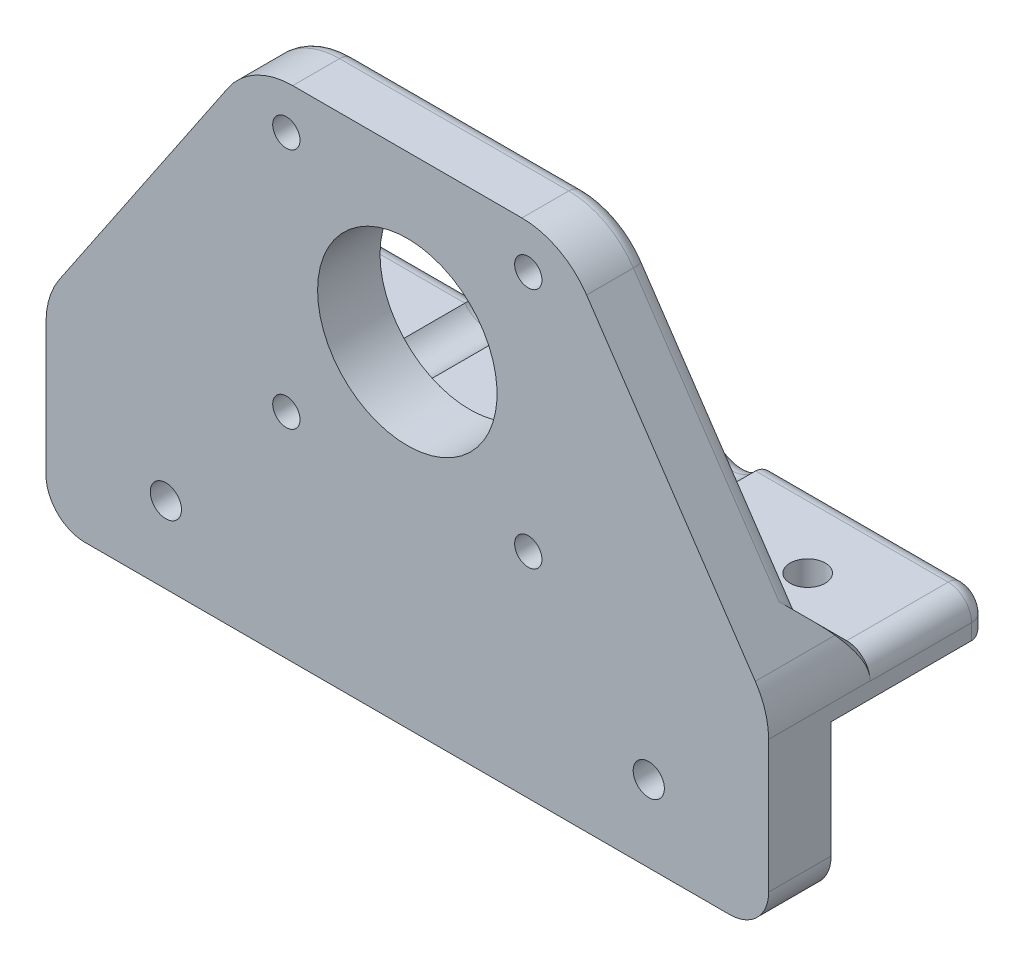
ISO-10303-21;
HEADER;
FILE_DESCRIPTION(('STEP AP214'),'2;1');
FILE_NAME('part.step','',(''),(''),'','','');
FILE_SCHEMA(('AUTOMOTIVE_DESIGN { 1 0 10303 214 1 1 1 1 }'));
ENDSEC;
DATA;
#1=APPLICATION_CONTEXT('core data for automotive mechanical design processes');
#2=APPLICATION_PROTOCOL_DEFINITION('international standard','automotive_design',2000,#1);
#3=PRODUCT_CONTEXT('',#1,'mechanical');
#4=PRODUCT('Part','Part','',(#3));
#5=PRODUCT_RELATED_PRODUCT_CATEGORY('part','',(#4));
#6=PRODUCT_DEFINITION_FORMATION('','',#4);
#7=PRODUCT_DEFINITION_CONTEXT('part definition',#1,'design');
#8=PRODUCT_DEFINITION('design','',#6,#7);
#9=PRODUCT_DEFINITION_SHAPE('','',#8);
#10=(LENGTH_UNIT() NAMED_UNIT(*) SI_UNIT(.MILLI.,.METRE.));
#11=(NAMED_UNIT(*) PLANE_ANGLE_UNIT() SI_UNIT($,.RADIAN.));
#12=(NAMED_UNIT(*) SI_UNIT($,.STERADIAN.) SOLID_ANGLE_UNIT());
#13=UNCERTAINTY_MEASURE_WITH_UNIT(LENGTH_MEASURE(1.E-05),#10,'distance_accuracy_value','');
#14=(GEOMETRIC_REPRESENTATION_CONTEXT(3) GLOBAL_UNCERTAINTY_ASSIGNED_CONTEXT((#13)) GLOBAL_UNIT_ASSIGNED_CONTEXT((#10,
#11,#12)) REPRESENTATION_CONTEXT('',''));
#15=CARTESIAN_POINT('',(0.,0.,0.));
#16=DIRECTION('',(0.,0.,1.));
#17=DIRECTION('',(1.,0.,0.));
#18=AXIS2_PLACEMENT_3D('',#15,#16,#17);
#19=CARTESIAN_POINT('',(641.29911776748,47.749005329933,-20.));
#20=DIRECTION('',(0.,0.,1.));
#21=DIRECTION('',(1.,0.,0.));
#22=AXIS2_PLACEMENT_3D('',#19,#20,#21);
#23=PLANE('',#22);
#24=DIRECTION('',(1.,0.,0.));
#25=VECTOR('',#24,1.);
#26=CARTESIAN_POINT('',(641.29911776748,48.749005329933,-20.));
#27=LINE('',#26,#25);
#28=CARTESIAN_POINT('',(617.468626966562,48.749005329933,-20.));
#29=VERTEX_POINT('',#28);
#30=CARTESIAN_POINT('',(641.29911776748,48.749005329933,-20.));
#31=VERTEX_POINT('',#30);
#32=EDGE_CURVE('E453',#29,#31,#27,.T.);
#33=ORIENTED_EDGE('',*,*,#32,.T.);
#34=CARTESIAN_POINT('',(641.29911776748,47.749005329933,-20.));
#35=DIRECTION('',(0.,0.,1.));
#36=DIRECTION('',(1.,0.,0.));
#37=AXIS2_PLACEMENT_3D('',#34,#35,#36);
#38=CIRCLE('',#37,1.);
#39=CARTESIAN_POINT('',(642.29911776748,47.749005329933,-20.));
#40=VERTEX_POINT('',#39);
#41=EDGE_CURVE('E455',#31,#40,#38,.F.);
#42=ORIENTED_EDGE('',*,*,#41,.T.);
#43=DIRECTION('',(-1.,0.,0.));
#44=VECTOR('',#43,1.);
#45=CARTESIAN_POINT('',(641.29911776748,47.749005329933,-20.));
#46=LINE('',#45,#44);
#47=CARTESIAN_POINT('',(615.897915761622,47.749005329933,-20.));
#48=VERTEX_POINT('',#47);
#49=EDGE_CURVE('E449',#40,#48,#46,.T.);
#50=ORIENTED_EDGE('',*,*,#49,.T.);
#51=CARTESIAN_POINT('',(613.499999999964,53.2490053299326,-20.));
#52=DIRECTION('',(0.,0.,1.));
#53=DIRECTION('',(1.,0.,0.));
#54=AXIS2_PLACEMENT_3D('',#51,#52,#53);
#55=CIRCLE('',#54,5.99999999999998);
#56=EDGE_CURVE('E451',#48,#29,#55,.T.);
#57=ORIENTED_EDGE('',*,*,#56,.T.);
#58=EDGE_LOOP('',(#33,#42,#50,#57));
#59=FACE_BOUND('',#58,.T.);
#60=ADVANCED_FACE('F37',(#59),#23,.F.);
#61=DIRECTION('',(1.,0.,0.));
#62=VECTOR('',#61,1.);
#63=CARTESIAN_POINT('',(641.29911776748,48.749005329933,-20.));
#64=LINE('',#63,#62);
#65=CARTESIAN_POINT('',(586.468626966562,48.749005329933,-20.));
#66=VERTEX_POINT('',#65);
#67=CARTESIAN_POINT('',(609.531373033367,48.749005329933,-20.));
#68=VERTEX_POINT('',#67);
#69=EDGE_CURVE('E444',#66,#68,#64,.T.);
#70=ORIENTED_EDGE('',*,*,#69,.T.);
#71=CARTESIAN_POINT('',(613.499999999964,53.2490053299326,-20.));
#72=DIRECTION('',(0.,0.,1.));
#73=DIRECTION('',(1.,0.,0.));
#74=AXIS2_PLACEMENT_3D('',#71,#72,#73);
#75=CIRCLE('',#74,5.99999999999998);
#76=CARTESIAN_POINT('',(611.102084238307,47.749005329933,-20.));
#77=VERTEX_POINT('',#76);
#78=EDGE_CURVE('E446',#68,#77,#75,.T.);
#79=ORIENTED_EDGE('',*,*,#78,.T.);
#80=DIRECTION('',(-1.,0.,0.));
#81=VECTOR('',#80,1.);
#82=CARTESIAN_POINT('',(641.29911776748,47.749005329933,-20.));
#83=LINE('',#82,#81);
#84=CARTESIAN_POINT('',(584.897915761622,47.749005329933,-20.));
#85=VERTEX_POINT('',#84);
#86=EDGE_CURVE('E440',#77,#85,#83,.T.);
#87=ORIENTED_EDGE('',*,*,#86,.T.);
#88=CARTESIAN_POINT('',(582.499999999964,53.2490053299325,-20.));
#89=DIRECTION('',(0.,0.,1.));
#90=DIRECTION('',(1.,0.,0.));
#91=AXIS2_PLACEMENT_3D('',#88,#89,#90);
#92=CIRCLE('',#91,5.99999999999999);
#93=EDGE_CURVE('E442',#85,#66,#92,.T.);
#94=ORIENTED_EDGE('',*,*,#93,.T.);
#95=EDGE_LOOP('',(#70,#79,#87,#94));
#96=FACE_BOUND('',#95,.T.);
#97=ADVANCED_FACE('F641',(#96),#23,.F.);
#98=CARTESIAN_POINT('',(582.499999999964,53.2490053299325,0.));
#99=DIRECTION('',(0.,0.,1.));
#100=DIRECTION('',(1.,0.,0.));
#101=AXIS2_PLACEMENT_3D('',#98,#99,#100);
#102=CYLINDRICAL_SURFACE('',#101,1.74999999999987);
#103=CARTESIAN_POINT('',(582.499999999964,53.2490053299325,8.));
#104=DIRECTION('',(0.,0.,1.));
#105=DIRECTION('',(1.,0.,0.));
#106=AXIS2_PLACEMENT_3D('',#103,#104,#105);
#107=CIRCLE('',#106,1.74999999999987);
#108=CARTESIAN_POINT('',(584.249999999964,53.2490053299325,8.));
#109=VERTEX_POINT('',#108);
#110=EDGE_CURVE('E331',#109,#109,#107,.T.);
#111=ORIENTED_EDGE('',*,*,#110,.T.);
#112=EDGE_LOOP('',(#111));
#113=FACE_BOUND('',#112,.T.);
#114=CARTESIAN_POINT('',(582.499999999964,53.2490053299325,3.));
#115=DIRECTION('',(0.,0.,-1.));
#116=DIRECTION('',(-1.,0.,0.));
#117=AXIS2_PLACEMENT_3D('',#114,#115,#116);
#118=CIRCLE('',#117,1.74999999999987);
#119=CARTESIAN_POINT('',(580.749999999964,53.2490053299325,3.));
#120=VERTEX_POINT('',#119);
#121=EDGE_CURVE('E429',#120,#120,#118,.F.);
#122=ORIENTED_EDGE('',*,*,#121,.F.);
#123=EDGE_LOOP('',(#122));
#124=FACE_BOUND('',#123,.T.);
#125=ADVANCED_FACE('F649',(#113,#124),#102,.F.);
#126=CARTESIAN_POINT('',(613.499999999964,53.2490053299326,0.));
#127=DIRECTION('',(0.,0.,1.));
#128=DIRECTION('',(1.,0.,0.));
#129=AXIS2_PLACEMENT_3D('',#126,#127,#128);
#130=CYLINDRICAL_SURFACE('',#129,1.74999999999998);
#131=CARTESIAN_POINT('',(613.499999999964,53.2490053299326,8.));
#132=DIRECTION('',(0.,0.,1.));
#133=DIRECTION('',(1.,0.,0.));
#134=AXIS2_PLACEMENT_3D('',#131,#132,#133);
#135=CIRCLE('',#134,1.74999999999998);
#136=CARTESIAN_POINT('',(615.249999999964,53.2490053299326,8.));
#137=VERTEX_POINT('',#136);
#138=EDGE_CURVE('E336',#137,#137,#135,.T.);
#139=ORIENTED_EDGE('',*,*,#138,.T.);
#140=EDGE_LOOP('',(#139));
#141=FACE_BOUND('',#140,.T.);
#142=CARTESIAN_POINT('',(613.499999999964,53.2490053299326,3.));
#143=DIRECTION('',(0.,0.,-1.));
#144=DIRECTION('',(-1.,0.,0.));
#145=AXIS2_PLACEMENT_3D('',#142,#143,#144);
#146=CIRCLE('',#145,1.74999999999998);
#147=CARTESIAN_POINT('',(611.749999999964,53.2490053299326,3.));
#148=VERTEX_POINT('',#147);
#149=EDGE_CURVE('E425',#148,#148,#146,.F.);
#150=ORIENTED_EDGE('',*,*,#149,.F.);
#151=EDGE_LOOP('',(#150));
#152=FACE_BOUND('',#151,.T.);
#153=ADVANCED_FACE('F1175',(#141,#152),#130,.F.);
#154=CARTESIAN_POINT('',(582.499999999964,84.2490053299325,0.));
#155=DIRECTION('',(0.,0.,1.));
#156=DIRECTION('',(1.,0.,0.));
#157=AXIS2_PLACEMENT_3D('',#154,#155,#156);
#158=CYLINDRICAL_SURFACE('',#157,1.74999999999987);
#159=CARTESIAN_POINT('',(582.499999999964,84.2490053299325,8.));
#160=DIRECTION('',(0.,0.,1.));
#161=DIRECTION('',(1.,0.,0.));
#162=AXIS2_PLACEMENT_3D('',#159,#160,#161);
#163=CIRCLE('',#162,1.74999999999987);
#164=CARTESIAN_POINT('',(584.249999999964,84.2490053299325,8.));
#165=VERTEX_POINT('',#164);
#166=EDGE_CURVE('E332',#165,#165,#163,.T.);
#167=ORIENTED_EDGE('',*,*,#166,.T.);
#168=EDGE_LOOP('',(#167));
#169=FACE_BOUND('',#168,.T.);
#170=CARTESIAN_POINT('',(582.499999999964,84.2490053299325,3.));
#171=DIRECTION('',(0.,0.,-1.));
#172=DIRECTION('',(-1.,0.,0.));
#173=AXIS2_PLACEMENT_3D('',#170,#171,#172);
#174=CIRCLE('',#173,1.74999999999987);
#175=CARTESIAN_POINT('',(580.749999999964,84.2490053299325,3.));
#176=VERTEX_POINT('',#175);
#177=EDGE_CURVE('E422',#176,#176,#174,.F.);
#178=ORIENTED_EDGE('',*,*,#177,.F.);
#179=EDGE_LOOP('',(#178));
#180=FACE_BOUND('',#179,.T.);
#181=ADVANCED_FACE('F1169',(#169,#180),#158,.F.);
#182=CARTESIAN_POINT('',(613.499999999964,84.2490053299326,0.));
#183=DIRECTION('',(0.,0.,1.));
#184=DIRECTION('',(1.,0.,0.));
#185=AXIS2_PLACEMENT_3D('',#182,#183,#184);
#186=CYLINDRICAL_SURFACE('',#185,1.75000000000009);
#187=CARTESIAN_POINT('',(613.499999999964,84.2490053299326,8.));
#188=DIRECTION('',(0.,0.,1.));
#189=DIRECTION('',(1.,0.,0.));
#190=AXIS2_PLACEMENT_3D('',#187,#188,#189);
#191=CIRCLE('',#190,1.75000000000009);
#192=CARTESIAN_POINT('',(615.249999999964,84.2490053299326,8.));
#193=VERTEX_POINT('',#192);
#194=EDGE_CURVE('E335',#193,#193,#191,.T.);
#195=ORIENTED_EDGE('',*,*,#194,.T.);
#196=EDGE_LOOP('',(#195));
#197=FACE_BOUND('',#196,.T.);
#198=CARTESIAN_POINT('',(613.499999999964,84.2490053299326,3.));
#199=DIRECTION('',(0.,0.,-1.));
#200=DIRECTION('',(-1.,0.,0.));
#201=AXIS2_PLACEMENT_3D('',#198,#199,#200);
#202=CIRCLE('',#201,1.75000000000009);
#203=CARTESIAN_POINT('',(611.749999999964,84.2490053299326,3.));
#204=VERTEX_POINT('',#203);
#205=EDGE_CURVE('E294',#204,#204,#202,.F.);
#206=ORIENTED_EDGE('',*,*,#205,.F.);
#207=EDGE_LOOP('',(#206));
#208=FACE_BOUND('',#207,.T.);
#209=ADVANCED_FACE('F919',(#197,#208),#186,.F.);
#210=CARTESIAN_POINT('',(556.700882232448,30.8557680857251,0.));
#211=DIRECTION('',(0.,0.,1.));
#212=DIRECTION('',(1.,0.,0.));
#213=AXIS2_PLACEMENT_3D('',#210,#211,#212);
#214=PLANE('',#213);
#215=CARTESIAN_POINT('',(582.499999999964,84.2490053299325,0.));
#216=DIRECTION('',(0.,0.,-1.));
#217=DIRECTION('',(-1.,0.,0.));
#218=AXIS2_PLACEMENT_3D('',#215,#216,#217);
#219=CIRCLE('',#218,3.24999999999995);
#220=CARTESIAN_POINT('',(579.249999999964,84.2490053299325,0.));
#221=VERTEX_POINT('',#220);
#222=EDGE_CURVE('E1089',#221,#221,#219,.T.);
#223=ORIENTED_EDGE('',*,*,#222,.F.);
#224=EDGE_LOOP('',(#223));
#225=FACE_BOUND('',#224,.T.);
#226=CARTESIAN_POINT('',(613.499999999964,53.2490053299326,0.));
#227=DIRECTION('',(0.,0.,-1.));
#228=DIRECTION('',(-1.,0.,0.));
#229=AXIS2_PLACEMENT_3D('',#226,#227,#228);
#230=CIRCLE('',#229,3.24999999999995);
#231=CARTESIAN_POINT('',(610.249999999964,53.2490053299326,0.));
#232=VERTEX_POINT('',#231);
#233=EDGE_CURVE('E1083',#232,#232,#230,.T.);
#234=ORIENTED_EDGE('',*,*,#233,.F.);
#235=EDGE_LOOP('',(#234));
#236=FACE_BOUND('',#235,.T.);
#237=CARTESIAN_POINT('',(582.499999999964,53.2490053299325,0.));
#238=DIRECTION('',(0.,0.,-1.));
#239=DIRECTION('',(-1.,0.,0.));
#240=AXIS2_PLACEMENT_3D('',#237,#238,#239);
#241=CIRCLE('',#240,3.24999999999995);
#242=CARTESIAN_POINT('',(579.249999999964,53.2490053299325,0.));
#243=VERTEX_POINT('',#242);
#244=EDGE_CURVE('E564',#243,#243,#241,.T.);
#245=ORIENTED_EDGE('',*,*,#244,.F.);
#246=EDGE_LOOP('',(#245));
#247=FACE_BOUND('',#246,.T.);
#248=CARTESIAN_POINT('',(613.499999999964,84.2490053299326,0.));
#249=DIRECTION('',(0.,0.,-1.));
#250=DIRECTION('',(-1.,0.,0.));
#251=AXIS2_PLACEMENT_3D('',#248,#249,#250);
#252=CIRCLE('',#251,3.24999999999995);
#253=CARTESIAN_POINT('',(610.249999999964,84.2490053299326,0.));
#254=VERTEX_POINT('',#253);
#255=EDGE_CURVE('E302',#254,#254,#252,.T.);
#256=ORIENTED_EDGE('',*,*,#255,.F.);
#257=EDGE_LOOP('',(#256));
#258=FACE_BOUND('',#257,.T.);
#259=CARTESIAN_POINT('',(597.999999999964,68.7490053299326,0.));
#260=DIRECTION('',(0.,0.,-1.));
#261=DIRECTION('',(-1.,0.,0.));
#262=AXIS2_PLACEMENT_3D('',#259,#260,#261);
#263=CIRCLE('',#262,11.4999999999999);
#264=CARTESIAN_POINT('',(586.499999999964,68.7490053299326,0.));
#265=VERTEX_POINT('',#264);
#266=EDGE_CURVE('E343',#265,#265,#263,.T.);
#267=ORIENTED_EDGE('',*,*,#266,.F.);
#268=EDGE_LOOP('',(#267));
#269=FACE_BOUND('',#268,.T.);
#270=DIRECTION('',(-1.,0.,0.));
#271=VECTOR('',#270,1.);
#272=CARTESIAN_POINT('',(554.700882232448,55.749005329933,0.));
#273=LINE('',#272,#271);
#274=CARTESIAN_POINT('',(579.377501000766,55.749005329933,0.));
#275=VERTEX_POINT('',#274);
#276=CARTESIAN_POINT('',(557.412813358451,55.749005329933,0.));
#277=VERTEX_POINT('',#276);
#278=EDGE_CURVE('E574',#275,#277,#273,.T.);
#279=ORIENTED_EDGE('',*,*,#278,.T.);
#280=DIRECTION('',(-0.559094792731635,-0.829103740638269,0.));
#281=VECTOR('',#280,1.);
#282=CARTESIAN_POINT('',(545.65107296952,38.3070561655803,0.));
#283=LINE('',#282,#281);
#284=CARTESIAN_POINT('',(576.685023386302,84.3285264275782,0.));
#285=VERTEX_POINT('',#284);
#286=EDGE_CURVE('E828',#277,#285,#283,.F.);
#287=ORIENTED_EDGE('',*,*,#286,.T.);
#288=CARTESIAN_POINT('',(583.317853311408,79.8557680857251,0.));
#289=DIRECTION('',(0.,0.,1.));
#290=DIRECTION('',(1.,0.,0.));
#291=AXIS2_PLACEMENT_3D('',#288,#289,#290);
#292=CIRCLE('',#291,7.99999999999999);
#293=CARTESIAN_POINT('',(583.317853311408,87.8557680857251,0.));
#294=VERTEX_POINT('',#293);
#295=EDGE_CURVE('E826',#285,#294,#292,.F.);
#296=ORIENTED_EDGE('',*,*,#295,.T.);
#297=DIRECTION('',(-1.,0.,0.));
#298=VECTOR('',#297,1.);
#299=CARTESIAN_POINT('',(556.700882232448,87.8557680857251,0.));
#300=LINE('',#299,#298);
#301=CARTESIAN_POINT('',(612.68214668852,87.8557680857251,0.));
#302=VERTEX_POINT('',#301);
#303=EDGE_CURVE('E824',#294,#302,#300,.F.);
#304=ORIENTED_EDGE('',*,*,#303,.T.);
#305=CARTESIAN_POINT('',(612.682146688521,79.8557680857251,0.));
#306=DIRECTION('',(0.,0.,1.));
#307=DIRECTION('',(1.,0.,0.));
#308=AXIS2_PLACEMENT_3D('',#305,#306,#307);
#309=CIRCLE('',#308,7.99999999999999);
#310=CARTESIAN_POINT('',(619.314976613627,84.3285264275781,0.));
#311=VERTEX_POINT('',#310);
#312=EDGE_CURVE('E822',#302,#311,#309,.F.);
#313=ORIENTED_EDGE('',*,*,#312,.T.);
#314=DIRECTION('',(-0.559094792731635,0.829103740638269,0.));
#315=VECTOR('',#314,1.);
#316=CARTESIAN_POINT('',(624.529793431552,76.5952686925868,0.));
#317=LINE('',#316,#315);
#318=CARTESIAN_POINT('',(638.587186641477,55.7490053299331,0.));
#319=VERTEX_POINT('',#318);
#320=EDGE_CURVE('E820',#311,#319,#317,.F.);
#321=ORIENTED_EDGE('',*,*,#320,.T.);
#322=DIRECTION('',(-1.,0.,0.));
#323=VECTOR('',#322,1.);
#324=CARTESIAN_POINT('',(616.622498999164,55.7490053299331,0.));
#325=LINE('',#324,#323);
#326=CARTESIAN_POINT('',(616.622498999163,55.7490053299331,0.));
#327=VERTEX_POINT('',#326);
#328=EDGE_CURVE('E569',#319,#327,#325,.T.);
#329=ORIENTED_EDGE('',*,*,#328,.T.);
#330=CARTESIAN_POINT('',(613.499999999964,53.2490053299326,0.));
#331=DIRECTION('',(0.,0.,1.));
#332=DIRECTION('',(-1.,0.,0.));
#333=AXIS2_PLACEMENT_3D('',#330,#331,#332);
#334=CIRCLE('',#333,3.99999999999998);
#335=CARTESIAN_POINT('',(610.377501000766,55.749005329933,0.));
#336=VERTEX_POINT('',#335);
#337=EDGE_CURVE('E296',#336,#327,#334,.T.);
#338=ORIENTED_EDGE('',*,*,#337,.F.);
#339=DIRECTION('',(-1.,0.,0.));
#340=VECTOR('',#339,1.);
#341=CARTESIAN_POINT('',(585.622498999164,55.749005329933,0.));
#342=LINE('',#341,#340);
#343=CARTESIAN_POINT('',(585.622498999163,55.749005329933,0.));
#344=VERTEX_POINT('',#343);
#345=EDGE_CURVE('E571',#336,#344,#342,.T.);
#346=ORIENTED_EDGE('',*,*,#345,.T.);
#347=CARTESIAN_POINT('',(582.499999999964,53.2490053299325,0.));
#348=DIRECTION('',(0.,0.,1.));
#349=DIRECTION('',(-1.,0.,0.));
#350=AXIS2_PLACEMENT_3D('',#347,#348,#349);
#351=CIRCLE('',#350,3.99999999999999);
#352=EDGE_CURVE('E293',#275,#344,#351,.T.);
#353=ORIENTED_EDGE('',*,*,#352,.F.);
#354=EDGE_LOOP('',(#279,#287,#296,#304,#313,#321,#329,#338,#346,#353));
#355=FACE_BOUND('',#354,.T.);
#356=ADVANCED_FACE('F629',(#225,#236,#247,#258,#269,#355),#214,.F.);
#357=CARTESIAN_POINT('',(628.938827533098,35.6592669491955,0.));
#358=DIRECTION('',(0.,0.,1.));
#359=DIRECTION('',(-1.,0.,0.));
#360=AXIS2_PLACEMENT_3D('',#357,#358,#359);
#361=CIRCLE('',#360,2.);
#362=CARTESIAN_POINT('',(626.938827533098,35.6592669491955,0.));
#363=VERTEX_POINT('',#362);
#364=EDGE_CURVE('E347',#363,#363,#361,.T.);
#365=ORIENTED_EDGE('',*,*,#364,.T.);
#366=EDGE_LOOP('',(#365));
#367=FACE_BOUND('',#366,.T.);
#368=CARTESIAN_POINT('',(567.061172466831,35.6592669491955,0.));
#369=DIRECTION('',(0.,0.,1.));
#370=DIRECTION('',(1.,0.,0.));
#371=AXIS2_PLACEMENT_3D('',#368,#369,#370);
#372=CIRCLE('',#371,2.);
#373=CARTESIAN_POINT('',(569.061172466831,35.6592669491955,0.));
#374=VERTEX_POINT('',#373);
#375=EDGE_CURVE('E353',#374,#374,#372,.T.);
#376=ORIENTED_EDGE('',*,*,#375,.T.);
#377=EDGE_LOOP('',(#376));
#378=FACE_BOUND('',#377,.T.);
#379=DIRECTION('',(-1.,0.,0.));
#380=VECTOR('',#379,1.);
#381=CARTESIAN_POINT('',(644.299117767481,45.749005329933,0.));
#382=LINE('',#381,#380);
#383=CARTESIAN_POINT('',(644.29911776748,45.749005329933,0.));
#384=VERTEX_POINT('',#383);
#385=CARTESIAN_POINT('',(551.700882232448,45.749005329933,0.));
#386=VERTEX_POINT('',#385);
#387=EDGE_CURVE('E284',#384,#386,#382,.T.);
#388=ORIENTED_EDGE('',*,*,#387,.F.);
#389=DIRECTION('',(0.,1.,0.));
#390=VECTOR('',#389,1.);
#391=CARTESIAN_POINT('',(644.29911776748,47.7991082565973,0.));
#392=LINE('',#391,#390);
#393=CARTESIAN_POINT('',(644.29911776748,30.8557680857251,0.));
#394=VERTEX_POINT('',#393);
#395=EDGE_CURVE('E289',#394,#384,#392,.T.);
#396=ORIENTED_EDGE('',*,*,#395,.F.);
#397=CARTESIAN_POINT('',(639.29911776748,30.8557680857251,0.));
#398=DIRECTION('',(0.,0.,1.));
#399=DIRECTION('',(-1.,0.,0.));
#400=AXIS2_PLACEMENT_3D('',#397,#398,#399);
#401=CIRCLE('',#400,5.00000000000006);
#402=CARTESIAN_POINT('',(639.29911776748,25.855768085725,0.));
#403=VERTEX_POINT('',#402);
#404=EDGE_CURVE('E389',#403,#394,#401,.T.);
#405=ORIENTED_EDGE('',*,*,#404,.F.);
#406=DIRECTION('',(1.,0.,0.));
#407=VECTOR('',#406,1.);
#408=CARTESIAN_POINT('',(556.700882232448,25.8557680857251,0.));
#409=LINE('',#408,#407);
#410=CARTESIAN_POINT('',(556.700882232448,25.8557680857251,0.));
#411=VERTEX_POINT('',#410);
#412=EDGE_CURVE('E387',#411,#403,#409,.T.);
#413=ORIENTED_EDGE('',*,*,#412,.F.);
#414=CARTESIAN_POINT('',(556.700882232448,30.8557680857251,0.));
#415=DIRECTION('',(0.,0.,1.));
#416=DIRECTION('',(1.,0.,0.));
#417=AXIS2_PLACEMENT_3D('',#414,#415,#416);
#418=CIRCLE('',#417,5.00000000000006);
#419=CARTESIAN_POINT('',(551.700882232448,30.8557680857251,0.));
#420=VERTEX_POINT('',#419);
#421=EDGE_CURVE('E287',#420,#411,#418,.T.);
#422=ORIENTED_EDGE('',*,*,#421,.F.);
#423=DIRECTION('',(0.,-1.,0.));
#424=VECTOR('',#423,1.);
#425=CARTESIAN_POINT('',(551.700882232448,47.7991082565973,0.));
#426=LINE('',#425,#424);
#427=EDGE_CURVE('E269',#386,#420,#426,.T.);
#428=ORIENTED_EDGE('',*,*,#427,.F.);
#429=EDGE_LOOP('',(#388,#396,#405,#413,#422,#428));
#430=FACE_BOUND('',#429,.T.);
#431=ADVANCED_FACE('F282',(#367,#378,#430),#214,.F.);
#432=CARTESIAN_POINT('',(556.700882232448,30.8557680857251,8.));
#433=DIRECTION('',(0.,0.,1.));
#434=DIRECTION('',(1.,0.,0.));
#435=AXIS2_PLACEMENT_3D('',#432,#433,#434);
#436=PLANE('',#435);
#437=ORIENTED_EDGE('',*,*,#166,.F.);
#438=EDGE_LOOP('',(#437));
#439=FACE_BOUND('',#438,.T.);
#440=ORIENTED_EDGE('',*,*,#138,.F.);
#441=EDGE_LOOP('',(#440));
#442=FACE_BOUND('',#441,.T.);
#443=ORIENTED_EDGE('',*,*,#110,.F.);
#444=EDGE_LOOP('',(#443));
#445=FACE_BOUND('',#444,.T.);
#446=ORIENTED_EDGE('',*,*,#194,.F.);
#447=EDGE_LOOP('',(#446));
#448=FACE_BOUND('',#447,.T.);
#449=CARTESIAN_POINT('',(597.999999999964,68.7490053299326,8.));
#450=DIRECTION('',(0.,0.,-1.));
#451=DIRECTION('',(-1.,0.,0.));
#452=AXIS2_PLACEMENT_3D('',#449,#450,#451);
#453=CIRCLE('',#452,11.4999999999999);
#454=CARTESIAN_POINT('',(586.499999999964,68.7490053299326,8.));
#455=VERTEX_POINT('',#454);
#456=EDGE_CURVE('E344',#455,#455,#453,.T.);
#457=ORIENTED_EDGE('',*,*,#456,.T.);
#458=EDGE_LOOP('',(#457));
#459=FACE_BOUND('',#458,.T.);
#460=CARTESIAN_POINT('',(567.061172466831,35.6592669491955,8.));
#461=DIRECTION('',(0.,0.,1.));
#462=DIRECTION('',(1.,0.,0.));
#463=AXIS2_PLACEMENT_3D('',#460,#461,#462);
#464=CIRCLE('',#463,2.);
#465=CARTESIAN_POINT('',(569.061172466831,35.6592669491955,8.));
#466=VERTEX_POINT('',#465);
#467=EDGE_CURVE('E356',#466,#466,#464,.T.);
#468=ORIENTED_EDGE('',*,*,#467,.F.);
#469=EDGE_LOOP('',(#468));
#470=FACE_BOUND('',#469,.T.);
#471=CARTESIAN_POINT('',(556.700882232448,30.8557680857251,8.));
#472=DIRECTION('',(0.,0.,1.));
#473=DIRECTION('',(1.,0.,0.));
#474=AXIS2_PLACEMENT_3D('',#471,#472,#473);
#475=CIRCLE('',#474,5.00000000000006);
#476=CARTESIAN_POINT('',(551.700882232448,30.8557680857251,8.));
#477=VERTEX_POINT('',#476);
#478=CARTESIAN_POINT('',(556.700882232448,25.8557680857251,8.));
#479=VERTEX_POINT('',#478);
#480=EDGE_CURVE('E288',#477,#479,#475,.T.);
#481=ORIENTED_EDGE('',*,*,#480,.T.);
#482=DIRECTION('',(1.,0.,0.));
#483=VECTOR('',#482,1.);
#484=CARTESIAN_POINT('',(556.700882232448,25.8557680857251,8.));
#485=LINE('',#484,#483);
#486=CARTESIAN_POINT('',(639.29911776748,25.855768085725,8.));
#487=VERTEX_POINT('',#486);
#488=EDGE_CURVE('E363',#479,#487,#485,.T.);
#489=ORIENTED_EDGE('',*,*,#488,.T.);
#490=CARTESIAN_POINT('',(639.29911776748,30.8557680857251,8.));
#491=DIRECTION('',(0.,0.,1.));
#492=DIRECTION('',(-1.,0.,0.));
#493=AXIS2_PLACEMENT_3D('',#490,#491,#492);
#494=CIRCLE('',#493,5.00000000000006);
#495=CARTESIAN_POINT('',(644.29911776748,30.8557680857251,8.));
#496=VERTEX_POINT('',#495);
#497=EDGE_CURVE('E365',#487,#496,#494,.T.);
#498=ORIENTED_EDGE('',*,*,#497,.T.);
#499=DIRECTION('',(0.,1.,0.));
#500=VECTOR('',#499,1.);
#501=CARTESIAN_POINT('',(644.29911776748,47.7991082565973,8.));
#502=LINE('',#501,#500);
#503=CARTESIAN_POINT('',(644.29911776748,47.7991082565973,8.));
#504=VERTEX_POINT('',#503);
#505=EDGE_CURVE('E367',#496,#504,#502,.T.);
#506=ORIENTED_EDGE('',*,*,#505,.T.);
#507=CARTESIAN_POINT('',(634.29911776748,47.7991082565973,8.));
#508=DIRECTION('',(0.,0.,1.));
#509=DIRECTION('',(-1.,0.,0.));
#510=AXIS2_PLACEMENT_3D('',#507,#508,#509);
#511=CIRCLE('',#510,10.);
#512=CARTESIAN_POINT('',(642.590155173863,53.3900561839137,8.));
#513=VERTEX_POINT('',#512);
#514=EDGE_CURVE('E369',#504,#513,#511,.T.);
#515=ORIENTED_EDGE('',*,*,#514,.T.);
#516=DIRECTION('',(-0.559094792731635,0.829103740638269,0.));
#517=VECTOR('',#516,1.);
#518=CARTESIAN_POINT('',(620.973184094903,85.4467160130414,8.));
#519=LINE('',#518,#517);
#520=CARTESIAN_POINT('',(620.973184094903,85.4467160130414,8.));
#521=VERTEX_POINT('',#520);
#522=EDGE_CURVE('E371',#513,#521,#519,.T.);
#523=ORIENTED_EDGE('',*,*,#522,.T.);
#524=CARTESIAN_POINT('',(612.682146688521,79.8557680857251,8.));
#525=DIRECTION('',(0.,0.,1.));
#526=DIRECTION('',(-1.,0.,0.));
#527=AXIS2_PLACEMENT_3D('',#524,#525,#526);
#528=CIRCLE('',#527,9.99999999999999);
#529=CARTESIAN_POINT('',(612.68214668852,89.8557680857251,8.));
#530=VERTEX_POINT('',#529);
#531=EDGE_CURVE('E373',#521,#530,#528,.T.);
#532=ORIENTED_EDGE('',*,*,#531,.T.);
#533=DIRECTION('',(-1.,0.,0.));
#534=VECTOR('',#533,1.);
#535=CARTESIAN_POINT('',(612.68214668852,89.8557680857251,8.));
#536=LINE('',#535,#534);
#537=CARTESIAN_POINT('',(583.317853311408,89.8557680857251,8.));
#538=VERTEX_POINT('',#537);
#539=EDGE_CURVE('E375',#530,#538,#536,.T.);
#540=ORIENTED_EDGE('',*,*,#539,.T.);
#541=CARTESIAN_POINT('',(583.317853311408,79.8557680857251,8.));
#542=DIRECTION('',(0.,0.,1.));
#543=DIRECTION('',(1.,0.,0.));
#544=AXIS2_PLACEMENT_3D('',#541,#542,#543);
#545=CIRCLE('',#544,9.99999999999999);
#546=CARTESIAN_POINT('',(575.026815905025,85.4467160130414,8.));
#547=VERTEX_POINT('',#546);
#548=EDGE_CURVE('E377',#538,#547,#545,.T.);
#549=ORIENTED_EDGE('',*,*,#548,.T.);
#550=DIRECTION('',(-0.559094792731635,-0.829103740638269,0.));
#551=VECTOR('',#550,1.);
#552=CARTESIAN_POINT('',(575.026815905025,85.4467160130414,8.));
#553=LINE('',#552,#551);
#554=CARTESIAN_POINT('',(553.409844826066,53.3900561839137,8.));
#555=VERTEX_POINT('',#554);
#556=EDGE_CURVE('E379',#547,#555,#553,.T.);
#557=ORIENTED_EDGE('',*,*,#556,.T.);
#558=CARTESIAN_POINT('',(561.700882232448,47.7991082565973,8.));
#559=DIRECTION('',(0.,0.,1.));
#560=DIRECTION('',(1.,0.,0.));
#561=AXIS2_PLACEMENT_3D('',#558,#559,#560);
#562=CIRCLE('',#561,10.);
#563=CARTESIAN_POINT('',(551.700882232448,47.7991082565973,8.));
#564=VERTEX_POINT('',#563);
#565=EDGE_CURVE('E381',#555,#564,#562,.T.);
#566=ORIENTED_EDGE('',*,*,#565,.T.);
#567=DIRECTION('',(0.,-1.,0.));
#568=VECTOR('',#567,1.);
#569=CARTESIAN_POINT('',(551.700882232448,47.7991082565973,8.));
#570=LINE('',#569,#568);
#571=EDGE_CURVE('E383',#564,#477,#570,.T.);
#572=ORIENTED_EDGE('',*,*,#571,.T.);
#573=EDGE_LOOP('',(#481,#489,#498,#506,#515,#523,#532,#540,#549,#557,#566,#572));
#574=FACE_BOUND('',#573,.T.);
#575=CARTESIAN_POINT('',(628.938827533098,35.6592669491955,8.));
#576=DIRECTION('',(0.,0.,1.));
#577=DIRECTION('',(-1.,0.,0.));
#578=AXIS2_PLACEMENT_3D('',#575,#576,#577);
#579=CIRCLE('',#578,2.);
#580=CARTESIAN_POINT('',(626.938827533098,35.6592669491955,8.));
#581=VERTEX_POINT('',#580);
#582=EDGE_CURVE('E350',#581,#581,#579,.T.);
#583=ORIENTED_EDGE('',*,*,#582,.F.);
#584=EDGE_LOOP('',(#583));
#585=FACE_BOUND('',#584,.T.);
#586=ADVANCED_FACE('F855',(#439,#442,#445,#448,#459,#470,#574,#585),#436,.T.);
#587=CARTESIAN_POINT('',(556.700882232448,30.8557680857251,8.));
#588=DIRECTION('',(0.,0.,-1.));
#589=DIRECTION('',(-1.,0.,0.));
#590=AXIS2_PLACEMENT_3D('',#587,#588,#589);
#591=CYLINDRICAL_SURFACE('',#590,5.00000000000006);
#592=ORIENTED_EDGE('',*,*,#421,.T.);
#593=DIRECTION('',(0.,0.,-1.));
#594=VECTOR('',#593,1.);
#595=CARTESIAN_POINT('',(556.700882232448,25.8557680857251,8.));
#596=LINE('',#595,#594);
#597=EDGE_CURVE('E418',#479,#411,#596,.T.);
#598=ORIENTED_EDGE('',*,*,#597,.F.);
#599=ORIENTED_EDGE('',*,*,#480,.F.);
#600=DIRECTION('',(0.,0.,-1.));
#601=VECTOR('',#600,1.);
#602=CARTESIAN_POINT('',(551.700882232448,30.8557680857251,8.));
#603=LINE('',#602,#601);
#604=EDGE_CURVE('E385',#477,#420,#603,.T.);
#605=ORIENTED_EDGE('',*,*,#604,.T.);
#606=EDGE_LOOP('',(#592,#598,#599,#605));
#607=FACE_BOUND('',#606,.T.);
#608=ADVANCED_FACE('F881',(#607),#591,.T.);
#609=CARTESIAN_POINT('',(556.700882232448,25.8557680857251,8.));
#610=DIRECTION('',(0.,1.,0.));
#611=DIRECTION('',(0.,0.,1.));
#612=AXIS2_PLACEMENT_3D('',#609,#610,#611);
#613=PLANE('',#612);
#614=ORIENTED_EDGE('',*,*,#412,.T.);
#615=DIRECTION('',(0.,0.,-1.));
#616=VECTOR('',#615,1.);
#617=CARTESIAN_POINT('',(639.29911776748,25.855768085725,8.));
#618=LINE('',#617,#616);
#619=EDGE_CURVE('E415',#487,#403,#618,.T.);
#620=ORIENTED_EDGE('',*,*,#619,.F.);
#621=ORIENTED_EDGE('',*,*,#488,.F.);
#622=ORIENTED_EDGE('',*,*,#597,.T.);
#623=EDGE_LOOP('',(#614,#620,#621,#622));
#624=FACE_BOUND('',#623,.T.);
#625=ADVANCED_FACE('F883',(#624),#613,.F.);
#626=CARTESIAN_POINT('',(639.29911776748,30.8557680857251,8.));
#627=DIRECTION('',(0.,0.,-1.));
#628=DIRECTION('',(-1.,0.,0.));
#629=AXIS2_PLACEMENT_3D('',#626,#627,#628);
#630=CYLINDRICAL_SURFACE('',#629,5.00000000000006);
#631=ORIENTED_EDGE('',*,*,#404,.T.);
#632=DIRECTION('',(0.,0.,-1.));
#633=VECTOR('',#632,1.);
#634=CARTESIAN_POINT('',(644.29911776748,30.8557680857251,8.));
#635=LINE('',#634,#633);
#636=EDGE_CURVE('E412',#496,#394,#635,.T.);
#637=ORIENTED_EDGE('',*,*,#636,.F.);
#638=ORIENTED_EDGE('',*,*,#497,.F.);
#639=ORIENTED_EDGE('',*,*,#619,.T.);
#640=EDGE_LOOP('',(#631,#637,#638,#639));
#641=FACE_BOUND('',#640,.T.);
#642=ADVANCED_FACE('F771',(#641),#630,.T.);
#643=CARTESIAN_POINT('',(644.29911776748,47.7991082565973,8.));
#644=DIRECTION('',(-1.,0.,0.));
#645=DIRECTION('',(0.,-1.,0.));
#646=AXIS2_PLACEMENT_3D('',#643,#644,#645);
#647=PLANE('',#646);
#648=DIRECTION('',(0.,0.,1.));
#649=VECTOR('',#648,1.);
#650=CARTESIAN_POINT('',(644.299117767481,45.749005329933,-20.));
#651=LINE('',#650,#649);
#652=CARTESIAN_POINT('',(644.299117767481,45.749005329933,-18.));
#653=VERTEX_POINT('',#652);
#654=EDGE_CURVE('E276',#653,#384,#651,.T.);
#655=ORIENTED_EDGE('',*,*,#654,.F.);
#656=DIRECTION('',(0.,-1.,0.));
#657=VECTOR('',#656,1.);
#658=CARTESIAN_POINT('',(644.29911776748,47.7991082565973,-18.));
#659=LINE('',#658,#657);
#660=CARTESIAN_POINT('',(644.29911776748,47.7490053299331,-18.));
#661=VERTEX_POINT('',#660);
#662=EDGE_CURVE('E476',#653,#661,#659,.F.);
#663=ORIENTED_EDGE('',*,*,#662,.T.);
#664=DIRECTION('',(0.,0.,1.));
#665=VECTOR('',#664,1.);
#666=CARTESIAN_POINT('',(644.29911776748,47.7490053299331,-20.));
#667=LINE('',#666,#665);
#668=CARTESIAN_POINT('',(644.29911776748,47.7490053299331,-5.00000000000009));
#669=VERTEX_POINT('',#668);
#670=EDGE_CURVE('E307',#661,#669,#667,.T.);
#671=ORIENTED_EDGE('',*,*,#670,.T.);
#672=CARTESIAN_POINT('',(644.29911776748,46.6617129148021,-4.80904327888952));
#673=CARTESIAN_POINT('',(644.29911776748,46.753399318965,-4.84031395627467));
#674=CARTESIAN_POINT('',(644.29911776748,46.8462406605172,-4.86842962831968));
#675=CARTESIAN_POINT('',(644.29911776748,47.0331273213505,-4.9170709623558));
#676=CARTESIAN_POINT('',(644.29911776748,47.1271582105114,-4.93765245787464));
#677=CARTESIAN_POINT('',(644.29911776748,47.3167956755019,-4.9704647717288));
#678=CARTESIAN_POINT('',(644.29911776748,47.4124034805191,-4.9826887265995));
#679=CARTESIAN_POINT('',(644.29911776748,47.5566992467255,-4.9942301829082));
#680=CARTESIAN_POINT('',(644.29911776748,47.6051345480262,-4.99694205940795));
#681=CARTESIAN_POINT('',(644.29911776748,47.7020865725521,-5.00002531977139));
#682=CARTESIAN_POINT('',(644.29911776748,47.7506033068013,-5.00039635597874));
#683=CARTESIAN_POINT('',(644.29911776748,47.7991082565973,-4.99958164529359));
#684=B_SPLINE_CURVE_WITH_KNOTS('',3,(#672,#673,#674,#675,#676,#677,#678,#679,#680,#681,#682,
#683),.UNSPECIFIED.,.F.,.F.,(4,2,2,2,2,4),(0.,0.290667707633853,0.579135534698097,
0.867839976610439,1.01332380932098,1.15882924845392),.UNSPECIFIED.);
#685=CARTESIAN_POINT('',(644.29911776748,47.7991082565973,-4.99958164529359));
#686=VERTEX_POINT('',#685);
#687=EDGE_CURVE('E720',#669,#686,#684,.T.);
#688=ORIENTED_EDGE('',*,*,#687,.T.);
#689=DIRECTION('',(0.,0.,-1.));
#690=VECTOR('',#689,1.);
#691=CARTESIAN_POINT('',(644.29911776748,47.7991082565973,8.));
#692=LINE('',#691,#690);
#693=EDGE_CURVE('E410',#504,#686,#692,.T.);
#694=ORIENTED_EDGE('',*,*,#693,.F.);
#695=ORIENTED_EDGE('',*,*,#505,.F.);
#696=ORIENTED_EDGE('',*,*,#636,.T.);
#697=ORIENTED_EDGE('',*,*,#395,.T.);
#698=EDGE_LOOP('',(#655,#663,#671,#688,#694,#695,#696,#697));
#699=FACE_BOUND('',#698,.T.);
#700=ADVANCED_FACE('F736',(#699),#647,.F.);
#701=CARTESIAN_POINT('',(634.29911776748,47.7991082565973,8.));
#702=DIRECTION('',(0.,0.,-1.));
#703=DIRECTION('',(-1.,0.,0.));
#704=AXIS2_PLACEMENT_3D('',#701,#702,#703);
#705=CYLINDRICAL_SURFACE('',#704,10.);
#706=ORIENTED_EDGE('',*,*,#693,.T.);
#707=CARTESIAN_POINT('',(644.297910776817,47.6437430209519,-4.99936012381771));
#708=CARTESIAN_POINT('',(644.298879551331,47.7060306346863,-5.00058310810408));
#709=CARTESIAN_POINT('',(644.299264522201,47.7683448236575,-5.0004380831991));
#710=CARTESIAN_POINT('',(644.298871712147,47.8928956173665,-4.99744126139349));
#711=CARTESIAN_POINT('',(644.298094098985,47.9551322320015,-4.99458985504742));
#712=CARTESIAN_POINT('',(644.294031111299,48.1412689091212,-4.9820392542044));
#713=CARTESIAN_POINT('',(644.289020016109,48.2648853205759,-4.96834904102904));
#714=CARTESIAN_POINT('',(644.274675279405,48.5082440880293,-4.93143501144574));
#715=CARTESIAN_POINT('',(644.265416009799,48.6280166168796,-4.90837597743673));
#716=CARTESIAN_POINT('',(644.242832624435,48.8652931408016,-4.8538781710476));
#717=CARTESIAN_POINT('',(644.229506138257,48.9827957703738,-4.82243451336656));
#718=CARTESIAN_POINT('',(644.190729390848,49.2785783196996,-4.73333386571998));
#719=CARTESIAN_POINT('',(644.16263204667,49.4550226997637,-4.6707371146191));
#720=CARTESIAN_POINT('',(644.09820751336,49.8013358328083,-4.53292100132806));
#721=CARTESIAN_POINT('',(644.061875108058,49.9712003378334,-4.45769364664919));
#722=CARTESIAN_POINT('',(643.981093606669,50.3070116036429,-4.29693270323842));
#723=CARTESIAN_POINT('',(643.936537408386,50.4728695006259,-4.21126889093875));
#724=CARTESIAN_POINT('',(643.840153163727,50.7986936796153,-4.03306832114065));
#725=CARTESIAN_POINT('',(643.78832281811,50.9586580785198,-3.94052939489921));
#726=CARTESIAN_POINT('',(643.659201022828,51.3259228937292,-3.71854763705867));
#727=CARTESIAN_POINT('',(643.579203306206,51.5310867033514,-3.58714487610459));
#728=CARTESIAN_POINT('',(643.407506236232,51.93249843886,-3.31840181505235));
#729=CARTESIAN_POINT('',(643.315802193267,52.1287427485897,-3.18105915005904));
#730=CARTESIAN_POINT('',(643.124034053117,52.5070245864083,-2.90650074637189));
#731=CARTESIAN_POINT('',(643.024294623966,52.6893100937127,-2.76939976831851));
#732=CARTESIAN_POINT('',(642.867095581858,52.9566684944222,-2.56194654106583));
#733=CARTESIAN_POINT('',(642.813455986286,53.0447391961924,-2.49252586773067));
#734=CARTESIAN_POINT('',(642.703673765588,53.2188895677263,-2.35317107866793));
#735=CARTESIAN_POINT('',(642.647531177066,53.3049692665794,-2.28323697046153));
#736=CARTESIAN_POINT('',(642.590155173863,53.3900561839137,-2.21309821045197));
#737=B_SPLINE_CURVE_WITH_KNOTS('',3,(#707,#708,#709,#710,#711,#712,#713,#714,#715,#716,#717,
#718,#719,#720,#721,#722,#723,#724,#725,#726,#727,#728,#729,#730,#731,#732,#733,#734,#735,#736),
.UNSPECIFIED.,.F.,.F.,(4,2,2,2,2,2,2,2,2,2,2,2,2,2,4),(0.,0.186885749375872,0.373744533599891,
0.746596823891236,1.11315706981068,1.47993136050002,2.04691295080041,2.61425468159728,
3.18958634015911,3.76510026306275,4.5338161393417,5.30284093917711,6.04927782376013,
6.42217086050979,6.79505844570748),.UNSPECIFIED.);
#738=CARTESIAN_POINT('',(642.590155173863,53.3900561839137,-2.21309821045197));
#739=VERTEX_POINT('',#738);
#740=EDGE_CURVE('E729',#686,#739,#737,.T.);
#741=ORIENTED_EDGE('',*,*,#740,.T.);
#742=DIRECTION('',(0.,0.,-1.));
#743=VECTOR('',#742,1.);
#744=CARTESIAN_POINT('',(642.590155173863,53.3900561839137,8.));
#745=LINE('',#744,#743);
#746=EDGE_CURVE('E408',#513,#739,#745,.T.);
#747=ORIENTED_EDGE('',*,*,#746,.F.);
#748=ORIENTED_EDGE('',*,*,#514,.F.);
#749=EDGE_LOOP('',(#706,#741,#747,#748));
#750=FACE_BOUND('',#749,.T.);
#751=ADVANCED_FACE('F764',(#750),#705,.T.);
#752=CARTESIAN_POINT('',(620.973184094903,85.4467160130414,8.));
#753=DIRECTION('',(-0.829103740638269,-0.559094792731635,0.));
#754=DIRECTION('',(0.559094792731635,-0.829103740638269,0.));
#755=AXIS2_PLACEMENT_3D('',#752,#753,#754);
#756=PLANE('',#755);
#757=DIRECTION('',(0.43040246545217,-0.638260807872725,-0.638260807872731));
#758=VECTOR('',#757,1.);
#759=CARTESIAN_POINT('',(626.933741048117,76.6075707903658,20.858565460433));
#760=LINE('',#759,#758);
#761=CARTESIAN_POINT('',(641.29911776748,55.3045865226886,-0.444418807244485));
#762=VERTEX_POINT('',#761);
#763=CARTESIAN_POINT('',(639.650757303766,57.749005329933,2.));
#764=VERTEX_POINT('',#763);
#765=EDGE_CURVE('E54',#762,#764,#760,.F.);
#766=ORIENTED_EDGE('',*,*,#765,.T.);
#767=DIRECTION('',(-0.559094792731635,0.829103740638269,0.));
#768=VECTOR('',#767,1.);
#769=CARTESIAN_POINT('',(620.973184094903,85.4467160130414,2.));
#770=LINE('',#769,#768);
#771=CARTESIAN_POINT('',(620.973184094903,85.4467160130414,2.));
#772=VERTEX_POINT('',#771);
#773=EDGE_CURVE('E58',#764,#772,#770,.T.);
#774=ORIENTED_EDGE('',*,*,#773,.T.);
#775=DIRECTION('',(0.,0.,-1.));
#776=VECTOR('',#775,1.);
#777=CARTESIAN_POINT('',(620.973184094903,85.4467160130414,8.));
#778=LINE('',#777,#776);
#779=EDGE_CURVE('E406',#521,#772,#778,.T.);
#780=ORIENTED_EDGE('',*,*,#779,.F.);
#781=ORIENTED_EDGE('',*,*,#522,.F.);
#782=ORIENTED_EDGE('',*,*,#746,.T.);
#783=CARTESIAN_POINT('',(641.29911776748,55.3045865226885,-0.444418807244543));
#784=CARTESIAN_POINT('',(641.360224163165,55.2139694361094,-0.535032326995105));
#785=CARTESIAN_POINT('',(641.421531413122,55.1230544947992,-0.625210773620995));
#786=CARTESIAN_POINT('',(641.54460749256,54.9405401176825,-0.80455968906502));
#787=CARTESIAN_POINT('',(641.606376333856,54.8489406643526,-0.893730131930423));
#788=CARTESIAN_POINT('',(641.792351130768,54.5731512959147,-1.15935976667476));
#789=CARTESIAN_POINT('',(641.917332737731,54.3878111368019,-1.33409728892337));
#790=CARTESIAN_POINT('',(642.106833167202,54.1067934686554,-1.59152846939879));
#791=CARTESIAN_POINT('',(642.17035249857,54.0125981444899,-1.6765782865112));
#792=CARTESIAN_POINT('',(642.298157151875,53.8230715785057,-1.84480975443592));
#793=CARTESIAN_POINT('',(642.362442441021,53.7277403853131,-1.92799148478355));
#794=CARTESIAN_POINT('',(642.491946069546,53.5356943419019,-2.09221595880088));
#795=CARTESIAN_POINT('',(642.557165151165,53.438978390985,-2.17325683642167));
#796=CARTESIAN_POINT('',(642.688627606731,53.244027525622,-2.33267172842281));
#797=CARTESIAN_POINT('',(642.754871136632,53.1457923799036,-2.41104533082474));
#798=CARTESIAN_POINT('',(642.821689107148,53.0467053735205,-2.48784531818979));
#799=B_SPLINE_CURVE_WITH_KNOTS('',3,(#783,#784,#785,#786,#787,#788,#789,#790,#791,#792,#793,
#794,#795,#796,#797,#798),.UNSPECIFIED.,.F.,.F.,(4,2,2,2,2,2,2,4),(0.,0.425913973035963,
0.851838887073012,1.70293885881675,2.12868044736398,2.55440387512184,2.98048689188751,
3.40663542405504),.UNSPECIFIED.);
#800=EDGE_CURVE('E750',#739,#762,#799,.F.);
#801=ORIENTED_EDGE('',*,*,#800,.T.);
#802=EDGE_LOOP('',(#766,#774,#780,#781,#782,#801));
#803=FACE_BOUND('',#802,.T.);
#804=ADVANCED_FACE('F759',(#803),#756,.F.);
#805=CARTESIAN_POINT('',(612.682146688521,79.8557680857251,8.));
#806=DIRECTION('',(0.,0.,-1.));
#807=DIRECTION('',(-1.,0.,0.));
#808=AXIS2_PLACEMENT_3D('',#805,#806,#807);
#809=CYLINDRICAL_SURFACE('',#808,9.99999999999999);
#810=ORIENTED_EDGE('',*,*,#779,.T.);
#811=CARTESIAN_POINT('',(612.682146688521,79.8557680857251,2.));
#812=DIRECTION('',(0.,0.,1.));
#813=DIRECTION('',(1.,0.,0.));
#814=AXIS2_PLACEMENT_3D('',#811,#812,#813);
#815=CIRCLE('',#814,9.99999999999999);
#816=CARTESIAN_POINT('',(612.68214668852,89.8557680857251,2.));
#817=VERTEX_POINT('',#816);
#818=EDGE_CURVE('E796',#772,#817,#815,.T.);
#819=ORIENTED_EDGE('',*,*,#818,.T.);
#820=DIRECTION('',(0.,0.,-1.));
#821=VECTOR('',#820,1.);
#822=CARTESIAN_POINT('',(612.68214668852,89.8557680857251,8.));
#823=LINE('',#822,#821);
#824=EDGE_CURVE('E403',#530,#817,#823,.T.);
#825=ORIENTED_EDGE('',*,*,#824,.F.);
#826=ORIENTED_EDGE('',*,*,#531,.F.);
#827=EDGE_LOOP('',(#810,#819,#825,#826));
#828=FACE_BOUND('',#827,.T.);
#829=ADVANCED_FACE('F763',(#828),#809,.T.);
#830=CARTESIAN_POINT('',(612.68214668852,89.8557680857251,8.));
#831=DIRECTION('',(0.,-1.,0.));
#832=DIRECTION('',(0.,0.,-1.));
#833=AXIS2_PLACEMENT_3D('',#830,#831,#832);
#834=PLANE('',#833);
#835=ORIENTED_EDGE('',*,*,#824,.T.);
#836=DIRECTION('',(-1.,0.,0.));
#837=VECTOR('',#836,1.);
#838=CARTESIAN_POINT('',(612.68214668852,89.8557680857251,2.));
#839=LINE('',#838,#837);
#840=CARTESIAN_POINT('',(583.317853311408,89.8557680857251,2.));
#841=VERTEX_POINT('',#840);
#842=EDGE_CURVE('E799',#817,#841,#839,.T.);
#843=ORIENTED_EDGE('',*,*,#842,.T.);
#844=DIRECTION('',(0.,0.,-1.));
#845=VECTOR('',#844,1.);
#846=CARTESIAN_POINT('',(583.317853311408,89.8557680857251,8.));
#847=LINE('',#846,#845);
#848=EDGE_CURVE('E400',#538,#841,#847,.T.);
#849=ORIENTED_EDGE('',*,*,#848,.F.);
#850=ORIENTED_EDGE('',*,*,#539,.F.);
#851=EDGE_LOOP('',(#835,#843,#849,#850));
#852=FACE_BOUND('',#851,.T.);
#853=ADVANCED_FACE('F833',(#852),#834,.F.);
#854=CARTESIAN_POINT('',(583.317853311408,79.8557680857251,8.));
#855=DIRECTION('',(0.,0.,-1.));
#856=DIRECTION('',(-1.,0.,0.));
#857=AXIS2_PLACEMENT_3D('',#854,#855,#856);
#858=CYLINDRICAL_SURFACE('',#857,9.99999999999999);
#859=ORIENTED_EDGE('',*,*,#848,.T.);
#860=CARTESIAN_POINT('',(583.317853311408,79.8557680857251,2.));
#861=DIRECTION('',(0.,0.,1.));
#862=DIRECTION('',(1.,0.,0.));
#863=AXIS2_PLACEMENT_3D('',#860,#861,#862);
#864=CIRCLE('',#863,9.99999999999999);
#865=CARTESIAN_POINT('',(575.026815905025,85.4467160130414,2.));
#866=VERTEX_POINT('',#865);
#867=EDGE_CURVE('E830',#841,#866,#864,.T.);
#868=ORIENTED_EDGE('',*,*,#867,.T.);
#869=DIRECTION('',(0.,0.,-1.));
#870=VECTOR('',#869,1.);
#871=CARTESIAN_POINT('',(575.026815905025,85.4467160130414,8.));
#872=LINE('',#871,#870);
#873=EDGE_CURVE('E397',#547,#866,#872,.T.);
#874=ORIENTED_EDGE('',*,*,#873,.F.);
#875=ORIENTED_EDGE('',*,*,#548,.F.);
#876=EDGE_LOOP('',(#859,#868,#874,#875));
#877=FACE_BOUND('',#876,.T.);
#878=ADVANCED_FACE('F638',(#877),#858,.T.);
#879=CARTESIAN_POINT('',(575.026815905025,85.4467160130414,8.));
#880=DIRECTION('',(0.829103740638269,-0.559094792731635,0.));
#881=DIRECTION('',(0.559094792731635,0.829103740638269,0.));
#882=AXIS2_PLACEMENT_3D('',#879,#880,#881);
#883=PLANE('',#882);
#884=ORIENTED_EDGE('',*,*,#873,.T.);
#885=DIRECTION('',(-0.559094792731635,-0.829103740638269,0.));
#886=VECTOR('',#885,1.);
#887=CARTESIAN_POINT('',(575.026815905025,85.4467160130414,2.));
#888=LINE('',#887,#886);
#889=CARTESIAN_POINT('',(556.349242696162,57.749005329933,2.));
#890=VERTEX_POINT('',#889);
#891=EDGE_CURVE('E757',#866,#890,#888,.T.);
#892=ORIENTED_EDGE('',*,*,#891,.T.);
#893=DIRECTION('',(0.430402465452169,0.638260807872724,0.638260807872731));
#894=VECTOR('',#893,1.);
#895=CARTESIAN_POINT('',(569.066258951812,76.6075707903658,20.858565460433));
#896=LINE('',#895,#894);
#897=CARTESIAN_POINT('',(554.700882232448,55.3045865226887,-0.444418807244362));
#898=VERTEX_POINT('',#897);
#899=EDGE_CURVE('E716',#890,#898,#896,.F.);
#900=ORIENTED_EDGE('',*,*,#899,.T.);
#901=CARTESIAN_POINT('',(554.700882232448,55.3045865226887,-0.444418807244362));
#902=CARTESIAN_POINT('',(554.639775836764,55.2139694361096,-0.535032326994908));
#903=CARTESIAN_POINT('',(554.578468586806,55.1230544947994,-0.625210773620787));
#904=CARTESIAN_POINT('',(554.455392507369,54.9405401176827,-0.804559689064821));
#905=CARTESIAN_POINT('',(554.393623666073,54.8489406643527,-0.893730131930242));
#906=CARTESIAN_POINT('',(554.20764886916,54.5731512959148,-1.15935976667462));
#907=CARTESIAN_POINT('',(554.082667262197,54.3878111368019,-1.33409728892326));
#908=CARTESIAN_POINT('',(553.893166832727,54.1067934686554,-1.59152846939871));
#909=CARTESIAN_POINT('',(553.829647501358,54.0125981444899,-1.67657828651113));
#910=CARTESIAN_POINT('',(553.701842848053,53.8230715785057,-1.84480975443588));
#911=CARTESIAN_POINT('',(553.637557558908,53.727740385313,-1.92799148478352));
#912=CARTESIAN_POINT('',(553.508053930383,53.5356943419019,-2.09221595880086));
#913=CARTESIAN_POINT('',(553.442834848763,53.438978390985,-2.17325683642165));
#914=CARTESIAN_POINT('',(553.311372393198,53.244027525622,-2.33267172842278));
#915=CARTESIAN_POINT('',(553.245128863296,53.1457923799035,-2.41104533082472));
#916=CARTESIAN_POINT('',(553.178310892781,53.0467053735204,-2.48784531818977));
#917=B_SPLINE_CURVE_WITH_KNOTS('',3,(#901,#902,#903,#904,#905,#906,#907,#908,#909,#910,#911,
#912,#913,#914,#915,#916),.UNSPECIFIED.,.F.,.F.,(4,2,2,2,2,2,2,4),(0.,0.425913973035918,
0.851838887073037,1.70293885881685,2.1286804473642,2.55440387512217,2.98048689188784,
3.40663542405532),.UNSPECIFIED.);
#918=CARTESIAN_POINT('',(553.409844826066,53.3900561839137,-2.2130982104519));
#919=VERTEX_POINT('',#918);
#920=EDGE_CURVE('E585',#898,#919,#917,.T.);
#921=ORIENTED_EDGE('',*,*,#920,.T.);
#922=DIRECTION('',(0.,0.,-1.));
#923=VECTOR('',#922,1.);
#924=CARTESIAN_POINT('',(553.409844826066,53.3900561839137,8.));
#925=LINE('',#924,#923);
#926=EDGE_CURVE('E395',#555,#919,#925,.T.);
#927=ORIENTED_EDGE('',*,*,#926,.F.);
#928=ORIENTED_EDGE('',*,*,#556,.F.);
#929=EDGE_LOOP('',(#884,#892,#900,#921,#927,#928));
#930=FACE_BOUND('',#929,.T.);
#931=ADVANCED_FACE('F601',(#930),#883,.F.);
#932=CARTESIAN_POINT('',(561.700882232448,47.7991082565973,8.));
#933=DIRECTION('',(0.,0.,-1.));
#934=DIRECTION('',(-1.,0.,0.));
#935=AXIS2_PLACEMENT_3D('',#932,#933,#934);
#936=CYLINDRICAL_SURFACE('',#935,10.);
#937=ORIENTED_EDGE('',*,*,#926,.T.);
#938=CARTESIAN_POINT('',(553.409844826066,53.3900561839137,-2.21309821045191));
#939=CARTESIAN_POINT('',(553.329508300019,53.2709138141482,-2.31129518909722));
#940=CARTESIAN_POINT('',(553.251584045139,53.1498248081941,-2.40911402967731));
#941=CARTESIAN_POINT('',(553.100665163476,52.9037266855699,-2.60366677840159));
#942=CARTESIAN_POINT('',(553.027671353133,52.7787169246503,-2.70040050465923));
#943=CARTESIAN_POINT('',(552.886315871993,52.5240164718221,-2.89300650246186));
#944=CARTESIAN_POINT('',(552.817985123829,52.394301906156,-2.98886993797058));
#945=CARTESIAN_POINT('',(552.686582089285,52.1308586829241,-3.17865416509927));
#946=CARTESIAN_POINT('',(552.623509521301,51.9971302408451,-3.27257506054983));
#947=CARTESIAN_POINT('',(552.499578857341,51.7183556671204,-3.46276465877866));
#948=CARTESIAN_POINT('',(552.439013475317,51.5730847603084,-3.55889552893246));
#949=CARTESIAN_POINT('',(552.324068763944,51.2776847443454,-3.7474035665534));
#950=CARTESIAN_POINT('',(552.269690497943,51.1275548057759,-3.83978008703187));
#951=CARTESIAN_POINT('',(552.167531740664,50.8225227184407,-4.01922204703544));
#952=CARTESIAN_POINT('',(552.119734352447,50.6676340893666,-4.10630075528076));
#953=CARTESIAN_POINT('',(552.030938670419,50.3523421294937,-4.27358999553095));
#954=CARTESIAN_POINT('',(551.989937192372,50.1919414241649,-4.35380373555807));
#955=CARTESIAN_POINT('',(551.924480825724,49.9057268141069,-4.48613847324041));
#956=CARTESIAN_POINT('',(551.898445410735,49.7812157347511,-4.54028908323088));
#957=CARTESIAN_POINT('',(551.850745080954,49.5286495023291,-4.64195264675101));
#958=CARTESIAN_POINT('',(551.829080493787,49.4005940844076,-4.6894651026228));
#959=CARTESIAN_POINT('',(551.790749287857,49.1429686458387,-4.77554046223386));
#960=CARTESIAN_POINT('',(551.774011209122,49.0134518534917,-4.81422928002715));
#961=CARTESIAN_POINT('',(551.745451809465,48.7513493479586,-4.88181881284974));
#962=CARTESIAN_POINT('',(551.733628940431,48.6187646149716,-4.9107226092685));
#963=CARTESIAN_POINT('',(551.716720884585,48.372836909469,-4.95334261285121));
#964=CARTESIAN_POINT('',(551.710856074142,48.2598433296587,-4.96875744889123));
#965=CARTESIAN_POINT('',(551.702970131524,48.0328687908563,-4.99079927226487));
#966=CARTESIAN_POINT('',(551.700948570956,47.9188879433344,-4.99742723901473));
#967=CARTESIAN_POINT('',(551.700817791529,47.6883462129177,-5.00158103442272));
#968=CARTESIAN_POINT('',(551.702791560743,47.5717813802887,-4.99891294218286));
#969=CARTESIAN_POINT('',(551.708781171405,47.3974759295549,-4.98788130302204));
#970=CARTESIAN_POINT('',(551.71128456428,47.3394352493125,-4.98302827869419));
#971=CARTESIAN_POINT('',(551.717285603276,47.223643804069,-4.9710518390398));
#972=CARTESIAN_POINT('',(551.720783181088,47.1658930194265,-4.96392857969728));
#973=CARTESIAN_POINT('',(551.724769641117,47.10832785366,-4.95570799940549));
#974=B_SPLINE_CURVE_WITH_KNOTS('',3,(#938,#939,#940,#941,#942,#943,#944,#945,#946,#947,#948,
#949,#950,#951,#952,#953,#954,#955,#956,#957,#958,#959,#960,#961,#962,#963,#964,#965,#966,#967,
#968,#969,#970,#971,#972,#973),.UNSPECIFIED.,.F.,.F.,(4,2,2,2,2,2,2,2,2,2,2,2,2,2,2,2,2,4),(0.,
0.52211408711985,1.04431442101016,1.56969549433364,2.09504841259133,2.64813721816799,
3.20132093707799,3.75305671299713,4.30453323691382,4.71905904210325,5.13361590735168,
5.5418240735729,5.94990357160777,6.29209850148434,6.63425528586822,6.98359200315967,
7.15843698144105,7.33326994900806),.UNSPECIFIED.);
#975=CARTESIAN_POINT('',(551.700882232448,47.7991082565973,-4.99958164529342));
#976=VERTEX_POINT('',#975);
#977=EDGE_CURVE('E594',#919,#976,#974,.T.);
#978=ORIENTED_EDGE('',*,*,#977,.T.);
#979=DIRECTION('',(0.,0.,-1.));
#980=VECTOR('',#979,1.);
#981=CARTESIAN_POINT('',(551.700882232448,47.7991082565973,8.));
#982=LINE('',#981,#980);
#983=EDGE_CURVE('E393',#564,#976,#982,.T.);
#984=ORIENTED_EDGE('',*,*,#983,.F.);
#985=ORIENTED_EDGE('',*,*,#565,.F.);
#986=EDGE_LOOP('',(#937,#978,#984,#985));
#987=FACE_BOUND('',#986,.T.);
#988=ADVANCED_FACE('F628',(#987),#936,.T.);
#989=CARTESIAN_POINT('',(551.700882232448,47.7991082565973,8.));
#990=DIRECTION('',(1.,0.,0.));
#991=DIRECTION('',(0.,1.,0.));
#992=AXIS2_PLACEMENT_3D('',#989,#990,#991);
#993=PLANE('',#992);
#994=DIRECTION('',(0.,0.,1.));
#995=VECTOR('',#994,1.);
#996=CARTESIAN_POINT('',(551.700882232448,47.749005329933,-20.));
#997=LINE('',#996,#995);
#998=CARTESIAN_POINT('',(551.700882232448,47.749005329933,-18.));
#999=VERTEX_POINT('',#998);
#1000=CARTESIAN_POINT('',(551.700882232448,47.749005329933,-5.00000000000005));
#1001=VERTEX_POINT('',#1000);
#1002=EDGE_CURVE('E277',#999,#1001,#997,.T.);
#1003=ORIENTED_EDGE('',*,*,#1002,.F.);
#1004=DIRECTION('',(0.,1.,0.));
#1005=VECTOR('',#1004,1.);
#1006=CARTESIAN_POINT('',(551.700882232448,47.7991082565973,-18.));
#1007=LINE('',#1006,#1005);
#1008=CARTESIAN_POINT('',(551.700882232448,45.749005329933,-18.));
#1009=VERTEX_POINT('',#1008);
#1010=EDGE_CURVE('E272',#999,#1009,#1007,.F.);
#1011=ORIENTED_EDGE('',*,*,#1010,.T.);
#1012=DIRECTION('',(0.,0.,1.));
#1013=VECTOR('',#1012,1.);
#1014=CARTESIAN_POINT('',(551.700882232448,45.749005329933,-20.));
#1015=LINE('',#1014,#1013);
#1016=EDGE_CURVE('E264',#1009,#386,#1015,.T.);
#1017=ORIENTED_EDGE('',*,*,#1016,.T.);
#1018=ORIENTED_EDGE('',*,*,#427,.T.);
#1019=ORIENTED_EDGE('',*,*,#604,.F.);
#1020=ORIENTED_EDGE('',*,*,#571,.F.);
#1021=ORIENTED_EDGE('',*,*,#983,.T.);
#1022=CARTESIAN_POINT('',(551.700882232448,47.7991082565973,-4.99958164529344));
#1023=CARTESIAN_POINT('',(551.700882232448,47.7246799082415,-5.00085941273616));
#1024=CARTESIAN_POINT('',(551.700882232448,47.6502161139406,-4.99929976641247));
#1025=CARTESIAN_POINT('',(551.700882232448,47.5019633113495,-4.99074194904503));
#1026=CARTESIAN_POINT('',(551.700882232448,47.4281727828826,-4.98377029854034));
#1027=CARTESIAN_POINT('',(551.700882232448,47.2813030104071,-4.96463592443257));
#1028=CARTESIAN_POINT('',(551.700882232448,47.2082235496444,-4.95247483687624));
#1029=CARTESIAN_POINT('',(551.700882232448,47.0626577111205,-4.92332348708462));
#1030=CARTESIAN_POINT('',(551.700882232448,46.990175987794,-4.90630987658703));
#1031=CARTESIAN_POINT('',(551.700882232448,46.9183054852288,-4.88711352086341));
#1032=B_SPLINE_CURVE_WITH_KNOTS('',3,(#1022,#1023,#1024,#1025,#1026,#1027,#1028,#1029,#1030,
#1031),.UNSPECIFIED.,.F.,.F.,(4,2,2,2,4),(0.,0.223246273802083,0.445405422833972,
0.667494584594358,0.890670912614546),.UNSPECIFIED.);
#1033=EDGE_CURVE('E615',#976,#1001,#1032,.T.);
#1034=ORIENTED_EDGE('',*,*,#1033,.T.);
#1035=EDGE_LOOP('',(#1003,#1011,#1017,#1018,#1019,#1020,#1021,#1034));
#1036=FACE_BOUND('',#1035,.T.);
#1037=ADVANCED_FACE('F267',(#1036),#993,.F.);
#1038=CARTESIAN_POINT('',(567.061172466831,35.6592669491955,8.));
#1039=DIRECTION('',(0.,0.,-1.));
#1040=DIRECTION('',(-1.,0.,0.));
#1041=AXIS2_PLACEMENT_3D('',#1038,#1039,#1040);
#1042=CYLINDRICAL_SURFACE('',#1041,2.);
#1043=ORIENTED_EDGE('',*,*,#467,.T.);
#1044=EDGE_LOOP('',(#1043));
#1045=FACE_BOUND('',#1044,.T.);
#1046=ORIENTED_EDGE('',*,*,#375,.F.);
#1047=EDGE_LOOP('',(#1046));
#1048=FACE_BOUND('',#1047,.T.);
#1049=ADVANCED_FACE('F627',(#1045,#1048),#1042,.F.);
#1050=CARTESIAN_POINT('',(628.938827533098,35.6592669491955,8.));
#1051=DIRECTION('',(0.,0.,-1.));
#1052=DIRECTION('',(-1.,0.,0.));
#1053=AXIS2_PLACEMENT_3D('',#1050,#1051,#1052);
#1054=CYLINDRICAL_SURFACE('',#1053,2.);
#1055=ORIENTED_EDGE('',*,*,#582,.T.);
#1056=EDGE_LOOP('',(#1055));
#1057=FACE_BOUND('',#1056,.T.);
#1058=ORIENTED_EDGE('',*,*,#364,.F.);
#1059=EDGE_LOOP('',(#1058));
#1060=FACE_BOUND('',#1059,.T.);
#1061=ADVANCED_FACE('F1131',(#1057,#1060),#1054,.F.);
#1062=CARTESIAN_POINT('',(597.999999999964,68.7490053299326,8.));
#1063=DIRECTION('',(0.,0.,-1.));
#1064=DIRECTION('',(-1.,0.,0.));
#1065=AXIS2_PLACEMENT_3D('',#1062,#1063,#1064);
#1066=CYLINDRICAL_SURFACE('',#1065,11.4999999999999);
#1067=ORIENTED_EDGE('',*,*,#456,.F.);
#1068=EDGE_LOOP('',(#1067));
#1069=FACE_BOUND('',#1068,.T.);
#1070=ORIENTED_EDGE('',*,*,#266,.T.);
#1071=EDGE_LOOP('',(#1070));
#1072=FACE_BOUND('',#1071,.T.);
#1073=ADVANCED_FACE('F990',(#1069,#1072),#1066,.F.);
#1074=CARTESIAN_POINT('',(644.299117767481,45.749005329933,-20.));
#1075=DIRECTION('',(0.,1.,0.));
#1076=DIRECTION('',(0.,0.,1.));
#1077=AXIS2_PLACEMENT_3D('',#1074,#1075,#1076);
#1078=PLANE('',#1077);
#1079=CARTESIAN_POINT('',(597.999999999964,45.749005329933,-10.));
#1080=DIRECTION('',(0.,1.,0.));
#1081=DIRECTION('',(0.,0.,1.));
#1082=AXIS2_PLACEMENT_3D('',#1079,#1080,#1081);
#1083=CIRCLE('',#1082,2.25000000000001);
#1084=CARTESIAN_POINT('',(597.999999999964,45.749005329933,-7.74999999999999));
#1085=VERTEX_POINT('',#1084);
#1086=EDGE_CURVE('E1097',#1085,#1085,#1083,.T.);
#1087=ORIENTED_EDGE('',*,*,#1086,.T.);
#1088=EDGE_LOOP('',(#1087));
#1089=FACE_BOUND('',#1088,.T.);
#1090=CARTESIAN_POINT('',(631.29911776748,45.749005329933,-10.));
#1091=DIRECTION('',(0.,1.,0.));
#1092=DIRECTION('',(0.,0.,1.));
#1093=AXIS2_PLACEMENT_3D('',#1090,#1091,#1092);
#1094=CIRCLE('',#1093,2.25000000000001);
#1095=CARTESIAN_POINT('',(631.29911776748,45.749005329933,-7.74999999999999));
#1096=VERTEX_POINT('',#1095);
#1097=EDGE_CURVE('E1103',#1096,#1096,#1094,.T.);
#1098=ORIENTED_EDGE('',*,*,#1097,.T.);
#1099=EDGE_LOOP('',(#1098));
#1100=FACE_BOUND('',#1099,.T.);
#1101=CARTESIAN_POINT('',(564.700882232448,45.749005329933,-10.));
#1102=DIRECTION('',(0.,1.,0.));
#1103=DIRECTION('',(0.,0.,1.));
#1104=AXIS2_PLACEMENT_3D('',#1101,#1102,#1103);
#1105=CIRCLE('',#1104,2.25000000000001);
#1106=CARTESIAN_POINT('',(564.700882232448,45.749005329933,-7.74999999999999));
#1107=VERTEX_POINT('',#1106);
#1108=EDGE_CURVE('E807',#1107,#1107,#1105,.T.);
#1109=ORIENTED_EDGE('',*,*,#1108,.T.);
#1110=EDGE_LOOP('',(#1109));
#1111=FACE_BOUND('',#1110,.T.);
#1112=ORIENTED_EDGE('',*,*,#1016,.F.);
#1113=DIRECTION('',(-1.,0.,0.));
#1114=VECTOR('',#1113,1.);
#1115=CARTESIAN_POINT('',(644.299117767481,45.749005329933,-18.));
#1116=LINE('',#1115,#1114);
#1117=EDGE_CURVE('E474',#1009,#653,#1116,.F.);
#1118=ORIENTED_EDGE('',*,*,#1117,.T.);
#1119=ORIENTED_EDGE('',*,*,#654,.T.);
#1120=ORIENTED_EDGE('',*,*,#387,.T.);
#1121=EDGE_LOOP('',(#1112,#1118,#1119,#1120));
#1122=FACE_BOUND('',#1121,.T.);
#1123=ADVANCED_FACE('F291',(#1089,#1100,#1111,#1122),#1078,.F.);
#1124=CARTESIAN_POINT('',(554.700882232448,47.749005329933,-20.));
#1125=DIRECTION('',(0.,0.,1.));
#1126=DIRECTION('',(1.,0.,0.));
#1127=AXIS2_PLACEMENT_3D('',#1124,#1125,#1126);
#1128=CYLINDRICAL_SURFACE('',#1127,3.);
#1129=ORIENTED_EDGE('',*,*,#1002,.T.);
#1130=CARTESIAN_POINT('',(554.700882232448,47.749005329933,-5.00000000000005));
#1131=DIRECTION('',(0.,0.,1.));
#1132=DIRECTION('',(1.,0.,0.));
#1133=AXIS2_PLACEMENT_3D('',#1130,#1131,#1132);
#1134=CIRCLE('',#1133,3.);
#1135=CARTESIAN_POINT('',(554.700882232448,50.749005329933,-5.00000000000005));
#1136=VERTEX_POINT('',#1135);
#1137=EDGE_CURVE('E478',#1001,#1136,#1134,.F.);
#1138=ORIENTED_EDGE('',*,*,#1137,.T.);
#1139=DIRECTION('',(0.,0.,1.));
#1140=VECTOR('',#1139,1.);
#1141=CARTESIAN_POINT('',(554.700882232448,50.749005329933,-20.));
#1142=LINE('',#1141,#1140);
#1143=CARTESIAN_POINT('',(554.700882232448,50.749005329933,-18.));
#1144=VERTEX_POINT('',#1143);
#1145=EDGE_CURVE('E325',#1144,#1136,#1142,.T.);
#1146=ORIENTED_EDGE('',*,*,#1145,.F.);
#1147=CARTESIAN_POINT('',(554.700882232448,47.749005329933,-18.));
#1148=DIRECTION('',(0.,0.,1.));
#1149=DIRECTION('',(1.,0.,0.));
#1150=AXIS2_PLACEMENT_3D('',#1147,#1148,#1149);
#1151=CIRCLE('',#1150,3.);
#1152=EDGE_CURVE('E471',#1144,#999,#1151,.T.);
#1153=ORIENTED_EDGE('',*,*,#1152,.T.);
#1154=EDGE_LOOP('',(#1129,#1138,#1146,#1153));
#1155=FACE_BOUND('',#1154,.T.);
#1156=ADVANCED_FACE('F872',(#1155),#1128,.T.);
#1157=CARTESIAN_POINT('',(579.377501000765,50.749005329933,-20.));
#1158=DIRECTION('',(0.,-1.,0.));
#1159=DIRECTION('',(0.,0.,-1.));
#1160=AXIS2_PLACEMENT_3D('',#1157,#1158,#1159);
#1161=PLANE('',#1160);
#1162=CARTESIAN_POINT('',(564.700882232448,50.749005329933,-10.));
#1163=DIRECTION('',(0.,1.,0.));
#1164=DIRECTION('',(0.,0.,1.));
#1165=AXIS2_PLACEMENT_3D('',#1162,#1163,#1164);
#1166=CIRCLE('',#1165,2.25000000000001);
#1167=CARTESIAN_POINT('',(564.700882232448,50.749005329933,-7.74999999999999));
#1168=VERTEX_POINT('',#1167);
#1169=EDGE_CURVE('E1094',#1168,#1168,#1166,.T.);
#1170=ORIENTED_EDGE('',*,*,#1169,.F.);
#1171=EDGE_LOOP('',(#1170));
#1172=FACE_BOUND('',#1171,.T.);
#1173=ORIENTED_EDGE('',*,*,#1145,.T.);
#1174=DIRECTION('',(1.,0.,0.));
#1175=VECTOR('',#1174,1.);
#1176=CARTESIAN_POINT('',(579.377501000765,50.749005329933,-5.00000000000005));
#1177=LINE('',#1176,#1175);
#1178=CARTESIAN_POINT('',(579.377501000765,50.749005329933,-5.00000000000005));
#1179=VERTEX_POINT('',#1178);
#1180=EDGE_CURVE('E567',#1136,#1179,#1177,.T.);
#1181=ORIENTED_EDGE('',*,*,#1180,.T.);
#1182=DIRECTION('',(0.,0.,1.));
#1183=VECTOR('',#1182,1.);
#1184=CARTESIAN_POINT('',(579.377501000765,50.749005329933,-20.));
#1185=LINE('',#1184,#1183);
#1186=CARTESIAN_POINT('',(579.377501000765,50.749005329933,-18.));
#1187=VERTEX_POINT('',#1186);
#1188=EDGE_CURVE('E322',#1187,#1179,#1185,.T.);
#1189=ORIENTED_EDGE('',*,*,#1188,.F.);
#1190=DIRECTION('',(1.,0.,0.));
#1191=VECTOR('',#1190,1.);
#1192=CARTESIAN_POINT('',(579.377501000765,50.749005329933,-18.));
#1193=LINE('',#1192,#1191);
#1194=EDGE_CURVE('E469',#1187,#1144,#1193,.F.);
#1195=ORIENTED_EDGE('',*,*,#1194,.T.);
#1196=EDGE_LOOP('',(#1173,#1181,#1189,#1195));
#1197=FACE_BOUND('',#1196,.T.);
#1198=ADVANCED_FACE('F868',(#1172,#1197),#1161,.F.);
#1199=CARTESIAN_POINT('',(582.499999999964,53.2490053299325,-20.));
#1200=DIRECTION('',(0.,0.,1.));
#1201=DIRECTION('',(1.,0.,0.));
#1202=AXIS2_PLACEMENT_3D('',#1199,#1200,#1201);
#1203=CYLINDRICAL_SURFACE('',#1202,3.99999999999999);
#1204=DIRECTION('',(0.,0.,1.));
#1205=VECTOR('',#1204,1.);
#1206=CARTESIAN_POINT('',(585.622498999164,50.749005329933,-20.));
#1207=LINE('',#1206,#1205);
#1208=CARTESIAN_POINT('',(585.622498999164,50.749005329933,-18.));
#1209=VERTEX_POINT('',#1208);
#1210=CARTESIAN_POINT('',(585.622498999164,50.749005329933,-5.00000000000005));
#1211=VERTEX_POINT('',#1210);
#1212=EDGE_CURVE('E319',#1209,#1211,#1207,.T.);
#1213=ORIENTED_EDGE('',*,*,#1212,.F.);
#1214=CARTESIAN_POINT('',(582.499999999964,53.2490053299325,-18.));
#1215=DIRECTION('',(0.,0.,1.));
#1216=DIRECTION('',(1.,0.,0.));
#1217=AXIS2_PLACEMENT_3D('',#1214,#1215,#1216);
#1218=CIRCLE('',#1217,3.99999999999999);
#1219=EDGE_CURVE('E467',#1209,#1187,#1218,.F.);
#1220=ORIENTED_EDGE('',*,*,#1219,.T.);
#1221=ORIENTED_EDGE('',*,*,#1188,.T.);
#1222=CARTESIAN_POINT('',(582.499999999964,53.2490053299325,-2.50000000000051));
#1223=DIRECTION('',(0.,0.707106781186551,-0.707106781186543));
#1224=DIRECTION('',(0.,0.707106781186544,0.707106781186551));
#1225=AXIS2_PLACEMENT_3D('',#1222,#1223,#1224);
#1226=ELLIPSE('',#1225,5.65685424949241,3.99999999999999);
#1227=EDGE_CURVE('E622',#1179,#275,#1226,.T.);
#1228=ORIENTED_EDGE('',*,*,#1227,.T.);
#1229=ORIENTED_EDGE('',*,*,#352,.T.);
#1230=CARTESIAN_POINT('',(582.499999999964,53.2490053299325,-2.50000000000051));
#1231=DIRECTION('',(0.,0.707106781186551,-0.707106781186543));
#1232=DIRECTION('',(0.,0.707106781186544,0.707106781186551));
#1233=AXIS2_PLACEMENT_3D('',#1230,#1231,#1232);
#1234=ELLIPSE('',#1233,5.65685424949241,3.99999999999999);
#1235=EDGE_CURVE('E707',#344,#1211,#1234,.T.);
#1236=ORIENTED_EDGE('',*,*,#1235,.T.);
#1237=EDGE_LOOP('',(#1213,#1220,#1221,#1228,#1229,#1236));
#1238=FACE_BOUND('',#1237,.T.);
#1239=ADVANCED_FACE('F704',(#1238),#1203,.F.);
#1240=CARTESIAN_POINT('',(610.377501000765,50.749005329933,-20.));
#1241=DIRECTION('',(0.,-1.,0.));
#1242=DIRECTION('',(0.,0.,-1.));
#1243=AXIS2_PLACEMENT_3D('',#1240,#1241,#1242);
#1244=PLANE('',#1243);
#1245=CARTESIAN_POINT('',(597.999999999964,50.749005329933,-10.));
#1246=DIRECTION('',(0.,1.,0.));
#1247=DIRECTION('',(0.,0.,1.));
#1248=AXIS2_PLACEMENT_3D('',#1245,#1246,#1247);
#1249=CIRCLE('',#1248,2.25000000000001);
#1250=CARTESIAN_POINT('',(597.999999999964,50.749005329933,-7.74999999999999));
#1251=VERTEX_POINT('',#1250);
#1252=EDGE_CURVE('E1106',#1251,#1251,#1249,.T.);
#1253=ORIENTED_EDGE('',*,*,#1252,.F.);
#1254=EDGE_LOOP('',(#1253));
#1255=FACE_BOUND('',#1254,.T.);
#1256=ORIENTED_EDGE('',*,*,#1212,.T.);
#1257=DIRECTION('',(1.,0.,0.));
#1258=VECTOR('',#1257,1.);
#1259=CARTESIAN_POINT('',(610.377501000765,50.749005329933,-5.00000000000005));
#1260=LINE('',#1259,#1258);
#1261=CARTESIAN_POINT('',(610.377501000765,50.749005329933,-5.00000000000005));
#1262=VERTEX_POINT('',#1261);
#1263=EDGE_CURVE('E577',#1211,#1262,#1260,.T.);
#1264=ORIENTED_EDGE('',*,*,#1263,.T.);
#1265=DIRECTION('',(0.,0.,1.));
#1266=VECTOR('',#1265,1.);
#1267=CARTESIAN_POINT('',(610.377501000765,50.749005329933,-20.));
#1268=LINE('',#1267,#1266);
#1269=CARTESIAN_POINT('',(610.377501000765,50.749005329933,-18.));
#1270=VERTEX_POINT('',#1269);
#1271=EDGE_CURVE('E316',#1270,#1262,#1268,.T.);
#1272=ORIENTED_EDGE('',*,*,#1271,.F.);
#1273=DIRECTION('',(1.,0.,0.));
#1274=VECTOR('',#1273,1.);
#1275=CARTESIAN_POINT('',(610.377501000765,50.749005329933,-18.));
#1276=LINE('',#1275,#1274);
#1277=EDGE_CURVE('E465',#1270,#1209,#1276,.F.);
#1278=ORIENTED_EDGE('',*,*,#1277,.T.);
#1279=EDGE_LOOP('',(#1256,#1264,#1272,#1278));
#1280=FACE_BOUND('',#1279,.T.);
#1281=ADVANCED_FACE('F701',(#1255,#1280),#1244,.F.);
#1282=CARTESIAN_POINT('',(613.499999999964,53.2490053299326,-20.));
#1283=DIRECTION('',(0.,0.,1.));
#1284=DIRECTION('',(1.,0.,0.));
#1285=AXIS2_PLACEMENT_3D('',#1282,#1283,#1284);
#1286=CYLINDRICAL_SURFACE('',#1285,3.99999999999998);
#1287=DIRECTION('',(0.,0.,1.));
#1288=VECTOR('',#1287,1.);
#1289=CARTESIAN_POINT('',(616.622498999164,50.749005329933,-20.));
#1290=LINE('',#1289,#1288);
#1291=CARTESIAN_POINT('',(616.622498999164,50.749005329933,-18.));
#1292=VERTEX_POINT('',#1291);
#1293=CARTESIAN_POINT('',(616.622498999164,50.749005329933,-5.00000000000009));
#1294=VERTEX_POINT('',#1293);
#1295=EDGE_CURVE('E313',#1292,#1294,#1290,.T.);
#1296=ORIENTED_EDGE('',*,*,#1295,.F.);
#1297=CARTESIAN_POINT('',(613.499999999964,53.2490053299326,-18.));
#1298=DIRECTION('',(0.,0.,1.));
#1299=DIRECTION('',(1.,0.,0.));
#1300=AXIS2_PLACEMENT_3D('',#1297,#1298,#1299);
#1301=CIRCLE('',#1300,3.99999999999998);
#1302=EDGE_CURVE('E463',#1292,#1270,#1301,.F.);
#1303=ORIENTED_EDGE('',*,*,#1302,.T.);
#1304=ORIENTED_EDGE('',*,*,#1271,.T.);
#1305=CARTESIAN_POINT('',(613.499999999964,53.2490053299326,-2.5000000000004));
#1306=DIRECTION('',(0.,0.707106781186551,-0.707106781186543));
#1307=DIRECTION('',(0.,0.707106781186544,0.707106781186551));
#1308=AXIS2_PLACEMENT_3D('',#1305,#1306,#1307);
#1309=ELLIPSE('',#1308,5.65685424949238,3.99999999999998);
#1310=EDGE_CURVE('E711',#1262,#336,#1309,.T.);
#1311=ORIENTED_EDGE('',*,*,#1310,.T.);
#1312=ORIENTED_EDGE('',*,*,#337,.T.);
#1313=CARTESIAN_POINT('',(613.499999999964,53.2490053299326,-2.50000000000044));
#1314=DIRECTION('',(0.,0.707106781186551,-0.707106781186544));
#1315=DIRECTION('',(0.,0.707106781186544,0.707106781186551));
#1316=AXIS2_PLACEMENT_3D('',#1313,#1314,#1315);
#1317=ELLIPSE('',#1316,5.65685424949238,3.99999999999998);
#1318=EDGE_CURVE('E713',#327,#1294,#1317,.T.);
#1319=ORIENTED_EDGE('',*,*,#1318,.T.);
#1320=EDGE_LOOP('',(#1296,#1303,#1304,#1311,#1312,#1319));
#1321=FACE_BOUND('',#1320,.T.);
#1322=ADVANCED_FACE('F903',(#1321),#1286,.F.);
#1323=CARTESIAN_POINT('',(641.29911776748,50.749005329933,-20.));
#1324=DIRECTION('',(0.,-1.,0.));
#1325=DIRECTION('',(0.,0.,-1.));
#1326=AXIS2_PLACEMENT_3D('',#1323,#1324,#1325);
#1327=PLANE('',#1326);
#1328=CARTESIAN_POINT('',(631.29911776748,50.749005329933,-10.));
#1329=DIRECTION('',(0.,1.,0.));
#1330=DIRECTION('',(0.,0.,1.));
#1331=AXIS2_PLACEMENT_3D('',#1328,#1329,#1330);
#1332=CIRCLE('',#1331,2.25000000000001);
#1333=CARTESIAN_POINT('',(631.29911776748,50.749005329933,-7.74999999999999));
#1334=VERTEX_POINT('',#1333);
#1335=EDGE_CURVE('E1100',#1334,#1334,#1332,.T.);
#1336=ORIENTED_EDGE('',*,*,#1335,.F.);
#1337=EDGE_LOOP('',(#1336));
#1338=FACE_BOUND('',#1337,.T.);
#1339=ORIENTED_EDGE('',*,*,#1295,.T.);
#1340=DIRECTION('',(1.,0.,0.));
#1341=VECTOR('',#1340,1.);
#1342=CARTESIAN_POINT('',(641.29911776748,50.749005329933,-5.00000000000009));
#1343=LINE('',#1342,#1341);
#1344=CARTESIAN_POINT('',(641.29911776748,50.749005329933,-5.00000000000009));
#1345=VERTEX_POINT('',#1344);
#1346=EDGE_CURVE('E580',#1294,#1345,#1343,.T.);
#1347=ORIENTED_EDGE('',*,*,#1346,.T.);
#1348=DIRECTION('',(0.,0.,1.));
#1349=VECTOR('',#1348,1.);
#1350=CARTESIAN_POINT('',(641.29911776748,50.749005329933,-20.));
#1351=LINE('',#1350,#1349);
#1352=CARTESIAN_POINT('',(641.29911776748,50.749005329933,-18.));
#1353=VERTEX_POINT('',#1352);
#1354=EDGE_CURVE('E310',#1353,#1345,#1351,.T.);
#1355=ORIENTED_EDGE('',*,*,#1354,.F.);
#1356=DIRECTION('',(1.,0.,0.));
#1357=VECTOR('',#1356,1.);
#1358=CARTESIAN_POINT('',(641.29911776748,50.749005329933,-18.));
#1359=LINE('',#1358,#1357);
#1360=EDGE_CURVE('E461',#1353,#1292,#1359,.F.);
#1361=ORIENTED_EDGE('',*,*,#1360,.T.);
#1362=EDGE_LOOP('',(#1339,#1347,#1355,#1361));
#1363=FACE_BOUND('',#1362,.T.);
#1364=ADVANCED_FACE('F665',(#1338,#1363),#1327,.F.);
#1365=CARTESIAN_POINT('',(641.29911776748,47.749005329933,-20.));
#1366=DIRECTION('',(0.,0.,1.));
#1367=DIRECTION('',(1.,0.,0.));
#1368=AXIS2_PLACEMENT_3D('',#1365,#1366,#1367);
#1369=CYLINDRICAL_SURFACE('',#1368,3.);
#1370=ORIENTED_EDGE('',*,*,#1354,.T.);
#1371=CARTESIAN_POINT('',(641.29911776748,47.749005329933,-5.00000000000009));
#1372=DIRECTION('',(0.,0.,1.));
#1373=DIRECTION('',(1.,0.,0.));
#1374=AXIS2_PLACEMENT_3D('',#1371,#1372,#1373);
#1375=CIRCLE('',#1374,3.);
#1376=EDGE_CURVE('E583',#1345,#669,#1375,.F.);
#1377=ORIENTED_EDGE('',*,*,#1376,.T.);
#1378=ORIENTED_EDGE('',*,*,#670,.F.);
#1379=CARTESIAN_POINT('',(641.29911776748,47.749005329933,-18.));
#1380=DIRECTION('',(0.,0.,1.));
#1381=DIRECTION('',(1.,0.,0.));
#1382=AXIS2_PLACEMENT_3D('',#1379,#1380,#1381);
#1383=CIRCLE('',#1382,3.);
#1384=EDGE_CURVE('E458',#661,#1353,#1383,.T.);
#1385=ORIENTED_EDGE('',*,*,#1384,.T.);
#1386=EDGE_LOOP('',(#1370,#1377,#1378,#1385));
#1387=FACE_BOUND('',#1386,.T.);
#1388=ADVANCED_FACE('F655',(#1387),#1369,.T.);
#1389=DIRECTION('',(1.,0.,0.));
#1390=VECTOR('',#1389,1.);
#1391=CARTESIAN_POINT('',(641.29911776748,48.749005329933,-20.));
#1392=LINE('',#1391,#1390);
#1393=CARTESIAN_POINT('',(554.700882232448,48.749005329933,-20.));
#1394=VERTEX_POINT('',#1393);
#1395=CARTESIAN_POINT('',(578.531373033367,48.749005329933,-20.));
#1396=VERTEX_POINT('',#1395);
#1397=EDGE_CURVE('E435',#1394,#1396,#1392,.T.);
#1398=ORIENTED_EDGE('',*,*,#1397,.T.);
#1399=CARTESIAN_POINT('',(582.499999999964,53.2490053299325,-20.));
#1400=DIRECTION('',(0.,0.,1.));
#1401=DIRECTION('',(1.,0.,0.));
#1402=AXIS2_PLACEMENT_3D('',#1399,#1400,#1401);
#1403=CIRCLE('',#1402,5.99999999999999);
#1404=CARTESIAN_POINT('',(580.102084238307,47.749005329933,-20.));
#1405=VERTEX_POINT('',#1404);
#1406=EDGE_CURVE('E437',#1396,#1405,#1403,.T.);
#1407=ORIENTED_EDGE('',*,*,#1406,.T.);
#1408=DIRECTION('',(-1.,0.,0.));
#1409=VECTOR('',#1408,1.);
#1410=CARTESIAN_POINT('',(641.29911776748,47.749005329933,-20.));
#1411=LINE('',#1410,#1409);
#1412=CARTESIAN_POINT('',(553.700882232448,47.749005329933,-20.));
#1413=VERTEX_POINT('',#1412);
#1414=EDGE_CURVE('E420',#1405,#1413,#1411,.T.);
#1415=ORIENTED_EDGE('',*,*,#1414,.T.);
#1416=CARTESIAN_POINT('',(554.700882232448,47.749005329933,-20.));
#1417=DIRECTION('',(0.,0.,1.));
#1418=DIRECTION('',(1.,0.,0.));
#1419=AXIS2_PLACEMENT_3D('',#1416,#1417,#1418);
#1420=CIRCLE('',#1419,1.);
#1421=EDGE_CURVE('E433',#1413,#1394,#1420,.F.);
#1422=ORIENTED_EDGE('',*,*,#1421,.T.);
#1423=EDGE_LOOP('',(#1398,#1407,#1415,#1422));
#1424=FACE_BOUND('',#1423,.T.);
#1425=ADVANCED_FACE('F644',(#1424),#23,.F.);
#1426=CARTESIAN_POINT('',(613.499999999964,84.2490053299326,3.));
#1427=DIRECTION('',(0.,0.,-1.));
#1428=DIRECTION('',(-1.,0.,0.));
#1429=AXIS2_PLACEMENT_3D('',#1426,#1427,#1428);
#1430=PLANE('',#1429);
#1431=CARTESIAN_POINT('',(613.499999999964,84.2490053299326,3.));
#1432=DIRECTION('',(0.,0.,-1.));
#1433=DIRECTION('',(-1.,0.,0.));
#1434=AXIS2_PLACEMENT_3D('',#1431,#1432,#1433);
#1435=CIRCLE('',#1434,3.24999999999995);
#1436=CARTESIAN_POINT('',(610.249999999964,84.2490053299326,3.));
#1437=VERTEX_POINT('',#1436);
#1438=EDGE_CURVE('E299',#1437,#1437,#1435,.T.);
#1439=ORIENTED_EDGE('',*,*,#1438,.T.);
#1440=EDGE_LOOP('',(#1439));
#1441=FACE_BOUND('',#1440,.T.);
#1442=ORIENTED_EDGE('',*,*,#205,.T.);
#1443=EDGE_LOOP('',(#1442));
#1444=FACE_BOUND('',#1443,.T.);
#1445=ADVANCED_FACE('F654',(#1441,#1444),#1430,.T.);
#1446=CARTESIAN_POINT('',(613.499999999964,84.2490053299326,3.));
#1447=DIRECTION('',(0.,0.,-1.));
#1448=DIRECTION('',(-1.,0.,0.));
#1449=AXIS2_PLACEMENT_3D('',#1446,#1447,#1448);
#1450=CYLINDRICAL_SURFACE('',#1449,3.24999999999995);
#1451=ORIENTED_EDGE('',*,*,#1438,.F.);
#1452=EDGE_LOOP('',(#1451));
#1453=FACE_BOUND('',#1452,.T.);
#1454=ORIENTED_EDGE('',*,*,#255,.T.);
#1455=EDGE_LOOP('',(#1454));
#1456=FACE_BOUND('',#1455,.T.);
#1457=ADVANCED_FACE('F661',(#1453,#1456),#1450,.F.);
#1458=CARTESIAN_POINT('',(582.499999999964,84.2490053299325,3.));
#1459=DIRECTION('',(0.,0.,-1.));
#1460=DIRECTION('',(-1.,0.,0.));
#1461=AXIS2_PLACEMENT_3D('',#1458,#1459,#1460);
#1462=PLANE('',#1461);
#1463=CARTESIAN_POINT('',(582.499999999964,84.2490053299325,3.));
#1464=DIRECTION('',(0.,0.,-1.));
#1465=DIRECTION('',(-1.,0.,0.));
#1466=AXIS2_PLACEMENT_3D('',#1463,#1464,#1465);
#1467=CIRCLE('',#1466,3.24999999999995);
#1468=CARTESIAN_POINT('',(579.249999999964,84.2490053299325,3.));
#1469=VERTEX_POINT('',#1468);
#1470=EDGE_CURVE('E426',#1469,#1469,#1467,.T.);
#1471=ORIENTED_EDGE('',*,*,#1470,.T.);
#1472=EDGE_LOOP('',(#1471));
#1473=FACE_BOUND('',#1472,.T.);
#1474=ORIENTED_EDGE('',*,*,#177,.T.);
#1475=EDGE_LOOP('',(#1474));
#1476=FACE_BOUND('',#1475,.T.);
#1477=ADVANCED_FACE('F1045',(#1473,#1476),#1462,.T.);
#1478=CARTESIAN_POINT('',(582.499999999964,84.2490053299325,3.));
#1479=DIRECTION('',(0.,0.,-1.));
#1480=DIRECTION('',(-1.,0.,0.));
#1481=AXIS2_PLACEMENT_3D('',#1478,#1479,#1480);
#1482=CYLINDRICAL_SURFACE('',#1481,3.24999999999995);
#1483=ORIENTED_EDGE('',*,*,#1470,.F.);
#1484=EDGE_LOOP('',(#1483));
#1485=FACE_BOUND('',#1484,.T.);
#1486=ORIENTED_EDGE('',*,*,#222,.T.);
#1487=EDGE_LOOP('',(#1486));
#1488=FACE_BOUND('',#1487,.T.);
#1489=ADVANCED_FACE('F1048',(#1485,#1488),#1482,.F.);
#1490=CARTESIAN_POINT('',(613.499999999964,53.2490053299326,3.));
#1491=DIRECTION('',(0.,0.,-1.));
#1492=DIRECTION('',(-1.,0.,0.));
#1493=AXIS2_PLACEMENT_3D('',#1490,#1491,#1492);
#1494=PLANE('',#1493);
#1495=CARTESIAN_POINT('',(613.499999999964,53.2490053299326,3.));
#1496=DIRECTION('',(0.,0.,-1.));
#1497=DIRECTION('',(-1.,0.,0.));
#1498=AXIS2_PLACEMENT_3D('',#1495,#1496,#1497);
#1499=CIRCLE('',#1498,3.24999999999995);
#1500=CARTESIAN_POINT('',(610.249999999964,53.2490053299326,3.));
#1501=VERTEX_POINT('',#1500);
#1502=EDGE_CURVE('E1086',#1501,#1501,#1499,.T.);
#1503=ORIENTED_EDGE('',*,*,#1502,.T.);
#1504=EDGE_LOOP('',(#1503));
#1505=FACE_BOUND('',#1504,.T.);
#1506=ORIENTED_EDGE('',*,*,#149,.T.);
#1507=EDGE_LOOP('',(#1506));
#1508=FACE_BOUND('',#1507,.T.);
#1509=ADVANCED_FACE('F1052',(#1505,#1508),#1494,.T.);
#1510=CARTESIAN_POINT('',(613.499999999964,53.2490053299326,3.));
#1511=DIRECTION('',(0.,0.,-1.));
#1512=DIRECTION('',(-1.,0.,0.));
#1513=AXIS2_PLACEMENT_3D('',#1510,#1511,#1512);
#1514=CYLINDRICAL_SURFACE('',#1513,3.24999999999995);
#1515=ORIENTED_EDGE('',*,*,#1502,.F.);
#1516=EDGE_LOOP('',(#1515));
#1517=FACE_BOUND('',#1516,.T.);
#1518=ORIENTED_EDGE('',*,*,#233,.T.);
#1519=EDGE_LOOP('',(#1518));
#1520=FACE_BOUND('',#1519,.T.);
#1521=ADVANCED_FACE('F1056',(#1517,#1520),#1514,.F.);
#1522=CARTESIAN_POINT('',(582.499999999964,53.2490053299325,3.));
#1523=DIRECTION('',(0.,0.,-1.));
#1524=DIRECTION('',(-1.,0.,0.));
#1525=AXIS2_PLACEMENT_3D('',#1522,#1523,#1524);
#1526=PLANE('',#1525);
#1527=CARTESIAN_POINT('',(582.499999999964,53.2490053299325,3.));
#1528=DIRECTION('',(0.,0.,-1.));
#1529=DIRECTION('',(-1.,0.,0.));
#1530=AXIS2_PLACEMENT_3D('',#1527,#1528,#1529);
#1531=CIRCLE('',#1530,3.24999999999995);
#1532=CARTESIAN_POINT('',(579.249999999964,53.2490053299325,3.));
#1533=VERTEX_POINT('',#1532);
#1534=EDGE_CURVE('E1080',#1533,#1533,#1531,.T.);
#1535=ORIENTED_EDGE('',*,*,#1534,.T.);
#1536=EDGE_LOOP('',(#1535));
#1537=FACE_BOUND('',#1536,.T.);
#1538=ORIENTED_EDGE('',*,*,#121,.T.);
#1539=EDGE_LOOP('',(#1538));
#1540=FACE_BOUND('',#1539,.T.);
#1541=ADVANCED_FACE('F1060',(#1537,#1540),#1526,.T.);
#1542=CARTESIAN_POINT('',(582.499999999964,53.2490053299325,3.));
#1543=DIRECTION('',(0.,0.,-1.));
#1544=DIRECTION('',(-1.,0.,0.));
#1545=AXIS2_PLACEMENT_3D('',#1542,#1543,#1544);
#1546=CYLINDRICAL_SURFACE('',#1545,3.24999999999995);
#1547=ORIENTED_EDGE('',*,*,#1534,.F.);
#1548=EDGE_LOOP('',(#1547));
#1549=FACE_BOUND('',#1548,.T.);
#1550=ORIENTED_EDGE('',*,*,#244,.T.);
#1551=EDGE_LOOP('',(#1550));
#1552=FACE_BOUND('',#1551,.T.);
#1553=ADVANCED_FACE('F1064',(#1549,#1552),#1546,.F.);
#1554=CARTESIAN_POINT('',(641.29911776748,48.749005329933,-18.));
#1555=DIRECTION('',(1.,0.,0.));
#1556=DIRECTION('',(0.,0.,-1.));
#1557=AXIS2_PLACEMENT_3D('',#1554,#1555,#1556);
#1558=CYLINDRICAL_SURFACE('',#1557,2.);
#1559=CARTESIAN_POINT('',(579.377501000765,50.749005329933,-18.));
#1560=CARTESIAN_POINT('',(579.377506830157,50.749013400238,-18.0525544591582));
#1561=CARTESIAN_POINT('',(579.376506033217,50.7469340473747,-18.1051040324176));
#1562=CARTESIAN_POINT('',(579.372535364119,50.7386627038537,-18.2097882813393));
#1563=CARTESIAN_POINT('',(579.369566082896,50.7324719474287,-18.2619230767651));
#1564=CARTESIAN_POINT('',(579.361716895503,50.716069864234,-18.3652161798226));
#1565=CARTESIAN_POINT('',(579.356843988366,50.7058732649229,-18.4163773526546));
#1566=CARTESIAN_POINT('',(579.34527370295,50.6815837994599,-18.5175427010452));
#1567=CARTESIAN_POINT('',(579.338576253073,50.6674907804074,-18.5675468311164));
#1568=CARTESIAN_POINT('',(579.315906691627,50.6195984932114,-18.7152340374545));
#1569=CARTESIAN_POINT('',(579.297343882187,50.5801582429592,-18.8107635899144));
#1570=CARTESIAN_POINT('',(579.254362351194,50.4877703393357,-18.9935883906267));
#1571=CARTESIAN_POINT('',(579.229939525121,50.4348132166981,-19.0808778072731));
#1572=CARTESIAN_POINT('',(579.175168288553,50.3144304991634,-19.2492518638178));
#1573=CARTESIAN_POINT('',(579.144600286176,50.2464548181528,-19.3298714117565));
#1574=CARTESIAN_POINT('',(579.079612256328,50.099673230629,-19.4787274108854));
#1575=CARTESIAN_POINT('',(579.045190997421,50.020863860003,-19.5469598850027));
#1576=CARTESIAN_POINT('',(578.97048409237,49.8470160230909,-19.6754312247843));
#1577=CARTESIAN_POINT('',(578.929949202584,49.7511571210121,-19.7344154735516));
#1578=CARTESIAN_POINT('',(578.84704195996,49.5515440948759,-19.8353312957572));
#1579=CARTESIAN_POINT('',(578.804668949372,49.4477871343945,-19.8772567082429));
#1580=CARTESIAN_POINT('',(578.724177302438,49.2472042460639,-19.9394691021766));
#1581=CARTESIAN_POINT('',(578.686125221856,49.1509393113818,-19.9616799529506));
#1582=CARTESIAN_POINT('',(578.610303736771,48.9562368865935,-19.9916626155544));
#1583=CARTESIAN_POINT('',(578.572533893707,48.8578046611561,-19.999466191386));
#1584=CARTESIAN_POINT('',(578.533965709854,48.7558632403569,-19.9999912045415));
#1585=CARTESIAN_POINT('',(578.532669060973,48.7524343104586,-20.0000000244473));
#1586=CARTESIAN_POINT('',(578.531373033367,48.749005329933,-20.));
#1587=B_SPLINE_CURVE_WITH_KNOTS('',3,(#1559,#1560,#1561,#1562,#1563,#1564,#1565,#1566,#1567,
#1568,#1569,#1570,#1571,#1572,#1573,#1574,#1575,#1576,#1577,#1578,#1579,#1580,#1581,#1582,#1583,
#1584,#1585,#1586),.UNSPECIFIED.,.F.,.F.,(4,2,2,2,2,2,2,2,2,2,2,2,2,4),(0.,0.157604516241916,
0.315161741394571,0.472145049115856,0.629134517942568,0.942596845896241,1.2562793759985,
1.58428017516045,1.91238609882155,2.26973768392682,2.62721821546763,2.94388820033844,
3.25985917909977,3.27085687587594),.UNSPECIFIED.);
#1588=EDGE_CURVE('E557',#1396,#1187,#1587,.F.);
#1589=ORIENTED_EDGE('',*,*,#1588,.F.);
#1590=ORIENTED_EDGE('',*,*,#1397,.F.);
#1591=CARTESIAN_POINT('',(554.700882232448,48.749005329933,-18.));
#1592=DIRECTION('',(-1.,0.,0.));
#1593=DIRECTION('',(0.,0.,1.));
#1594=AXIS2_PLACEMENT_3D('',#1591,#1592,#1593);
#1595=CIRCLE('',#1594,2.);
#1596=EDGE_CURVE('E556',#1144,#1394,#1595,.T.);
#1597=ORIENTED_EDGE('',*,*,#1596,.F.);
#1598=ORIENTED_EDGE('',*,*,#1194,.F.);
#1599=EDGE_LOOP('',(#1589,#1590,#1597,#1598));
#1600=FACE_BOUND('',#1599,.T.);
#1601=ADVANCED_FACE('F675',(#1600),#1558,.T.);
#1602=CARTESIAN_POINT('',(554.700882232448,47.749005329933,-18.));
#1603=DIRECTION('',(0.,0.,1.));
#1604=DIRECTION('',(1.,0.,0.));
#1605=AXIS2_PLACEMENT_3D('',#1602,#1603,#1604);
#1606=DEGENERATE_TOROIDAL_SURFACE('',#1605,1.,2.,.T.);
#1607=ORIENTED_EDGE('',*,*,#1596,.T.);
#1608=ORIENTED_EDGE('',*,*,#1421,.F.);
#1609=CARTESIAN_POINT('',(553.700882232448,47.749005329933,-18.));
#1610=DIRECTION('',(0.,-1.,0.));
#1611=DIRECTION('',(1.,0.,0.));
#1612=AXIS2_PLACEMENT_3D('',#1609,#1610,#1611);
#1613=CIRCLE('',#1612,2.);
#1614=EDGE_CURVE('E678',#999,#1413,#1613,.T.);
#1615=ORIENTED_EDGE('',*,*,#1614,.F.);
#1616=ORIENTED_EDGE('',*,*,#1152,.F.);
#1617=EDGE_LOOP('',(#1607,#1608,#1615,#1616));
#1618=FACE_BOUND('',#1617,.T.);
#1619=ADVANCED_FACE('F542',(#1618),#1606,.T.);
#1620=CARTESIAN_POINT('',(641.29911776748,48.749005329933,-18.));
#1621=DIRECTION('',(1.,0.,0.));
#1622=DIRECTION('',(0.,0.,-1.));
#1623=AXIS2_PLACEMENT_3D('',#1620,#1621,#1622);
#1624=CYLINDRICAL_SURFACE('',#1623,2.);
#1625=CARTESIAN_POINT('',(610.377501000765,50.749005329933,-18.));
#1626=CARTESIAN_POINT('',(610.377506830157,50.749013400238,-18.0525544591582));
#1627=CARTESIAN_POINT('',(610.376506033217,50.7469340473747,-18.1051040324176));
#1628=CARTESIAN_POINT('',(610.37253536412,50.7386627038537,-18.2097882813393));
#1629=CARTESIAN_POINT('',(610.369566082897,50.7324719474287,-18.2619230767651));
#1630=CARTESIAN_POINT('',(610.361716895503,50.716069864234,-18.3652161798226));
#1631=CARTESIAN_POINT('',(610.356843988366,50.7058732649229,-18.4163773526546));
#1632=CARTESIAN_POINT('',(610.34527370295,50.6815837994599,-18.5175427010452));
#1633=CARTESIAN_POINT('',(610.338576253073,50.6674907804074,-18.5675468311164));
#1634=CARTESIAN_POINT('',(610.315906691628,50.6195984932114,-18.7152340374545));
#1635=CARTESIAN_POINT('',(610.297343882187,50.5801582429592,-18.8107635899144));
#1636=CARTESIAN_POINT('',(610.254362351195,50.4877703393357,-18.9935883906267));
#1637=CARTESIAN_POINT('',(610.229939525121,50.4348132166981,-19.0808778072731));
#1638=CARTESIAN_POINT('',(610.175168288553,50.3144304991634,-19.2492518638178));
#1639=CARTESIAN_POINT('',(610.144600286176,50.2464548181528,-19.3298714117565));
#1640=CARTESIAN_POINT('',(610.079612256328,50.099673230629,-19.4787274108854));
#1641=CARTESIAN_POINT('',(610.045190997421,50.020863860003,-19.5469598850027));
#1642=CARTESIAN_POINT('',(609.970484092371,49.8470160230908,-19.6754312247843));
#1643=CARTESIAN_POINT('',(609.929949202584,49.7511571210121,-19.7344154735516));
#1644=CARTESIAN_POINT('',(609.84704195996,49.5515440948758,-19.8353312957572));
#1645=CARTESIAN_POINT('',(609.804668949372,49.4477871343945,-19.8772567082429));
#1646=CARTESIAN_POINT('',(609.724177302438,49.2472042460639,-19.9394691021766));
#1647=CARTESIAN_POINT('',(609.686125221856,49.150939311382,-19.9616799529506));
#1648=CARTESIAN_POINT('',(609.610303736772,48.9562368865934,-19.9916626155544));
#1649=CARTESIAN_POINT('',(609.572533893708,48.8578046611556,-19.999466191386));
#1650=CARTESIAN_POINT('',(609.533965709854,48.7558632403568,-19.9999912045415));
#1651=CARTESIAN_POINT('',(609.532669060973,48.7524343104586,-20.0000000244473));
#1652=CARTESIAN_POINT('',(609.531373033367,48.749005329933,-20.));
#1653=B_SPLINE_CURVE_WITH_KNOTS('',3,(#1625,#1626,#1627,#1628,#1629,#1630,#1631,#1632,#1633,
#1634,#1635,#1636,#1637,#1638,#1639,#1640,#1641,#1642,#1643,#1644,#1645,#1646,#1647,#1648,#1649,
#1650,#1651,#1652),.UNSPECIFIED.,.F.,.F.,(4,2,2,2,2,2,2,2,2,2,2,2,2,4),(0.,0.157604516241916,
0.315161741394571,0.472145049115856,0.629134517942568,0.942596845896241,1.2562793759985,
1.58428017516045,1.91238609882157,2.26973768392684,2.62721821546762,2.94388820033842,
3.25985917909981,3.27085687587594),.UNSPECIFIED.);
#1654=EDGE_CURVE('E527',#68,#1270,#1653,.F.);
#1655=ORIENTED_EDGE('',*,*,#1654,.F.);
#1656=ORIENTED_EDGE('',*,*,#69,.F.);
#1657=CARTESIAN_POINT('',(585.622498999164,50.749005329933,-18.));
#1658=CARTESIAN_POINT('',(585.622493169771,50.749013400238,-18.0525544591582));
#1659=CARTESIAN_POINT('',(585.623493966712,50.7469340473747,-18.1051040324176));
#1660=CARTESIAN_POINT('',(585.627464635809,50.7386627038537,-18.2097882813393));
#1661=CARTESIAN_POINT('',(585.630433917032,50.7324719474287,-18.2619230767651));
#1662=CARTESIAN_POINT('',(585.638283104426,50.716069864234,-18.3652161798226));
#1663=CARTESIAN_POINT('',(585.643156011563,50.7058732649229,-18.4163773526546));
#1664=CARTESIAN_POINT('',(585.654726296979,50.6815837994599,-18.5175427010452));
#1665=CARTESIAN_POINT('',(585.661423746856,50.6674907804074,-18.5675468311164));
#1666=CARTESIAN_POINT('',(585.684093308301,50.6195984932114,-18.7152340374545));
#1667=CARTESIAN_POINT('',(585.702656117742,50.5801582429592,-18.8107635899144));
#1668=CARTESIAN_POINT('',(585.745637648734,50.4877703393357,-18.9935883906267));
#1669=CARTESIAN_POINT('',(585.770060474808,50.4348132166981,-19.0808778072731));
#1670=CARTESIAN_POINT('',(585.824831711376,50.3144304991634,-19.2492518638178));
#1671=CARTESIAN_POINT('',(585.855399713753,50.2464548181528,-19.3298714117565));
#1672=CARTESIAN_POINT('',(585.920387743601,50.099673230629,-19.4787274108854));
#1673=CARTESIAN_POINT('',(585.954809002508,50.020863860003,-19.5469598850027));
#1674=CARTESIAN_POINT('',(586.029515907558,49.8470160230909,-19.6754312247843));
#1675=CARTESIAN_POINT('',(586.070050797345,49.7511571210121,-19.7344154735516));
#1676=CARTESIAN_POINT('',(586.152958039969,49.5515440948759,-19.8353312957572));
#1677=CARTESIAN_POINT('',(586.195331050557,49.4477871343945,-19.8772567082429));
#1678=CARTESIAN_POINT('',(586.275822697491,49.2472042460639,-19.9394691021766));
#1679=CARTESIAN_POINT('',(586.313874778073,49.1509393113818,-19.9616799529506));
#1680=CARTESIAN_POINT('',(586.389696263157,48.9562368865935,-19.9916626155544));
#1681=CARTESIAN_POINT('',(586.427466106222,48.8578046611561,-19.999466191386));
#1682=CARTESIAN_POINT('',(586.466034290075,48.7558632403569,-19.9999912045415));
#1683=CARTESIAN_POINT('',(586.467330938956,48.7524343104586,-20.0000000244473));
#1684=CARTESIAN_POINT('',(586.468626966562,48.749005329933,-20.));
#1685=B_SPLINE_CURVE_WITH_KNOTS('',3,(#1657,#1658,#1659,#1660,#1661,#1662,#1663,#1664,#1665,
#1666,#1667,#1668,#1669,#1670,#1671,#1672,#1673,#1674,#1675,#1676,#1677,#1678,#1679,#1680,#1681,
#1682,#1683,#1684),.UNSPECIFIED.,.F.,.F.,(4,2,2,2,2,2,2,2,2,2,2,2,2,4),(0.,0.157604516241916,
0.315161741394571,0.472145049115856,0.629134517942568,0.942596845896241,1.2562793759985,
1.58428017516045,1.91238609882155,2.26973768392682,2.62721821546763,2.94388820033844,
3.25985917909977,3.27085687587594),.UNSPECIFIED.);
#1686=EDGE_CURVE('E548',#1209,#66,#1685,.T.);
#1687=ORIENTED_EDGE('',*,*,#1686,.F.);
#1688=ORIENTED_EDGE('',*,*,#1277,.F.);
#1689=EDGE_LOOP('',(#1655,#1656,#1687,#1688));
#1690=FACE_BOUND('',#1689,.T.);
#1691=ADVANCED_FACE('F538',(#1690),#1624,.T.);
#1692=CARTESIAN_POINT('',(582.499999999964,53.2490053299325,-18.));
#1693=DIRECTION('',(0.,0.,1.));
#1694=DIRECTION('',(1.,0.,0.));
#1695=AXIS2_PLACEMENT_3D('',#1692,#1693,#1694);
#1696=TOROIDAL_SURFACE('',#1695,5.99999999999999,2.);
#1697=ORIENTED_EDGE('',*,*,#1686,.T.);
#1698=ORIENTED_EDGE('',*,*,#93,.F.);
#1699=CARTESIAN_POINT('',(580.102084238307,47.749005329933,-20.));
#1700=CARTESIAN_POINT('',(580.10670101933,47.7480426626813,-19.9999999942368));
#1701=CARTESIAN_POINT('',(580.11131837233,47.7470826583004,-19.999999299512));
#1702=CARTESIAN_POINT('',(580.27783429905,47.7125623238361,-19.9999497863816));
#1703=CARTESIAN_POINT('',(580.44043107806,47.6822753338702,-19.9990678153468));
#1704=CARTESIAN_POINT('',(580.766754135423,47.6284623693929,-19.9965458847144));
#1705=CARTESIAN_POINT('',(580.930480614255,47.6049376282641,-19.9949057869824));
#1706=CARTESIAN_POINT('',(581.258898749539,47.5648032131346,-19.9916013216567));
#1707=CARTESIAN_POINT('',(581.423590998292,47.5481983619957,-19.9899369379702));
#1708=CARTESIAN_POINT('',(581.753529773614,47.5220490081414,-19.9871246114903));
#1709=CARTESIAN_POINT('',(581.91877626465,47.5125040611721,-19.9859766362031));
#1710=CARTESIAN_POINT('',(582.249627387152,47.5005403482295,-19.9845154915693));
#1711=CARTESIAN_POINT('',(582.415232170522,47.4981257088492,-19.9842028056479));
#1712=CARTESIAN_POINT('',(582.746399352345,47.5004528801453,-19.9844956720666));
#1713=CARTESIAN_POINT('',(582.911961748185,47.5051950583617,-19.9851012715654));
#1714=CARTESIAN_POINT('',(583.242621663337,47.5217952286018,-19.9870693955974));
#1715=CARTESIAN_POINT('',(583.407719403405,47.5336489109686,-19.9884314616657));
#1716=CARTESIAN_POINT('',(583.737237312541,47.5643799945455,-19.9915201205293));
#1717=CARTESIAN_POINT('',(583.901657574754,47.5832563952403,-19.9932466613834));
#1718=CARTESIAN_POINT('',(584.134210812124,47.6149155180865,-19.9955214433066));
#1719=CARTESIAN_POINT('',(584.202739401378,47.6248591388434,-19.9961710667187));
#1720=CARTESIAN_POINT('',(584.339605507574,47.6459386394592,-19.9973705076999));
#1721=CARTESIAN_POINT('',(584.407943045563,47.6570743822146,-19.9979203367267));
#1722=CARTESIAN_POINT('',(584.612568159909,47.6922378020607,-19.9993321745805));
#1723=CARTESIAN_POINT('',(584.748561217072,47.7180343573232,-19.9999576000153));
#1724=CARTESIAN_POINT('',(584.888681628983,47.7470826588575,-19.9999993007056));
#1725=CARTESIAN_POINT('',(584.89329898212,47.7480426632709,-19.9999999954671));
#1726=CARTESIAN_POINT('',(584.897915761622,47.749005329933,-20.));
#1727=B_SPLINE_CURVE_WITH_KNOTS('',3,(#1699,#1700,#1701,#1702,#1703,#1704,#1705,#1706,#1707,
#1708,#1709,#1710,#1711,#1712,#1713,#1714,#1715,#1716,#1717,#1718,#1719,#1720,#1721,#1722,#1723,
#1724,#1725,#1726),.UNSPECIFIED.,.F.,.F.,(4,2,2,2,2,2,2,2,2,2,2,2,2,4),(0.,0.0141482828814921,
0.510167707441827,1.00627754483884,1.50273257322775,1.99915635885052,2.49586738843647,
2.99260392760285,3.48903974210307,3.98540485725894,4.19314408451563,4.40085944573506,
4.81600876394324,4.83015704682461),.UNSPECIFIED.);
#1728=EDGE_CURVE('E513',#1405,#85,#1727,.T.);
#1729=ORIENTED_EDGE('',*,*,#1728,.F.);
#1730=ORIENTED_EDGE('',*,*,#1406,.F.);
#1731=ORIENTED_EDGE('',*,*,#1588,.T.);
#1732=ORIENTED_EDGE('',*,*,#1219,.F.);
#1733=EDGE_LOOP('',(#1697,#1698,#1729,#1730,#1731,#1732));
#1734=FACE_BOUND('',#1733,.T.);
#1735=ADVANCED_FACE('F510',(#1734),#1696,.T.);
#1736=CARTESIAN_POINT('',(553.700882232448,47.7490053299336,-18.));
#1737=DIRECTION('',(0.,1.,0.));
#1738=DIRECTION('',(-1.,0.,0.));
#1739=AXIS2_PLACEMENT_3D('',#1736,#1737,#1738);
#1740=CYLINDRICAL_SURFACE('',#1739,2.);
#1741=ORIENTED_EDGE('',*,*,#1010,.F.);
#1742=ORIENTED_EDGE('',*,*,#1614,.T.);
#1743=CARTESIAN_POINT('',(553.700882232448,47.749005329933,-18.));
#1744=DIRECTION('',(-0.707106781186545,0.70710678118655,0.));
#1745=DIRECTION('',(-0.70710678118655,-0.707106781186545,0.));
#1746=AXIS2_PLACEMENT_3D('',#1743,#1744,#1745);
#1747=ELLIPSE('',#1746,2.8284271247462,2.);
#1748=EDGE_CURVE('E496',#1009,#1413,#1747,.F.);
#1749=ORIENTED_EDGE('',*,*,#1748,.F.);
#1750=EDGE_LOOP('',(#1741,#1742,#1749));
#1751=FACE_BOUND('',#1750,.T.);
#1752=ADVANCED_FACE('F544',(#1751),#1740,.T.);
#1753=CARTESIAN_POINT('',(613.499999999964,53.2490053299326,-18.));
#1754=DIRECTION('',(0.,0.,1.));
#1755=DIRECTION('',(1.,0.,0.));
#1756=AXIS2_PLACEMENT_3D('',#1753,#1754,#1755);
#1757=TOROIDAL_SURFACE('',#1756,5.99999999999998,2.);
#1758=CARTESIAN_POINT('',(616.622498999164,50.749005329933,-18.));
#1759=CARTESIAN_POINT('',(616.622493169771,50.749013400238,-18.0525544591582));
#1760=CARTESIAN_POINT('',(616.623493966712,50.7469340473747,-18.1051040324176));
#1761=CARTESIAN_POINT('',(616.627464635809,50.7386627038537,-18.2097882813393));
#1762=CARTESIAN_POINT('',(616.630433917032,50.7324719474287,-18.2619230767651));
#1763=CARTESIAN_POINT('',(616.638283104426,50.716069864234,-18.3652161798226));
#1764=CARTESIAN_POINT('',(616.643156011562,50.7058732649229,-18.4163773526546));
#1765=CARTESIAN_POINT('',(616.654726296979,50.6815837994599,-18.5175427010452));
#1766=CARTESIAN_POINT('',(616.661423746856,50.6674907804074,-18.5675468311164));
#1767=CARTESIAN_POINT('',(616.684093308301,50.6195984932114,-18.7152340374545));
#1768=CARTESIAN_POINT('',(616.702656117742,50.5801582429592,-18.8107635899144));
#1769=CARTESIAN_POINT('',(616.745637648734,50.4877703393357,-18.9935883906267));
#1770=CARTESIAN_POINT('',(616.770060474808,50.4348132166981,-19.0808778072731));
#1771=CARTESIAN_POINT('',(616.824831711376,50.3144304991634,-19.2492518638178));
#1772=CARTESIAN_POINT('',(616.855399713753,50.2464548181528,-19.3298714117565));
#1773=CARTESIAN_POINT('',(616.920387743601,50.099673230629,-19.4787274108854));
#1774=CARTESIAN_POINT('',(616.954809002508,50.020863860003,-19.5469598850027));
#1775=CARTESIAN_POINT('',(617.029515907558,49.8470160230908,-19.6754312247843));
#1776=CARTESIAN_POINT('',(617.070050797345,49.7511571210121,-19.7344154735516));
#1777=CARTESIAN_POINT('',(617.152958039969,49.5515440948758,-19.8353312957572));
#1778=CARTESIAN_POINT('',(617.195331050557,49.4477871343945,-19.8772567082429));
#1779=CARTESIAN_POINT('',(617.275822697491,49.2472042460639,-19.9394691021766));
#1780=CARTESIAN_POINT('',(617.313874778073,49.1509393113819,-19.9616799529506));
#1781=CARTESIAN_POINT('',(617.389696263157,48.9562368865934,-19.9916626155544));
#1782=CARTESIAN_POINT('',(617.427466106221,48.8578046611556,-19.999466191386));
#1783=CARTESIAN_POINT('',(617.466034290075,48.7558632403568,-19.9999912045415));
#1784=CARTESIAN_POINT('',(617.467330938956,48.7524343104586,-20.0000000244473));
#1785=CARTESIAN_POINT('',(617.468626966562,48.749005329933,-20.));
#1786=B_SPLINE_CURVE_WITH_KNOTS('',3,(#1758,#1759,#1760,#1761,#1762,#1763,#1764,#1765,#1766,
#1767,#1768,#1769,#1770,#1771,#1772,#1773,#1774,#1775,#1776,#1777,#1778,#1779,#1780,#1781,#1782,
#1783,#1784,#1785),.UNSPECIFIED.,.F.,.F.,(4,2,2,2,2,2,2,2,2,2,2,2,2,4),(0.,0.157604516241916,
0.315161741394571,0.472145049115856,0.629134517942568,0.942596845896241,1.2562793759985,
1.58428017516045,1.91238609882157,2.26973768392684,2.62721821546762,2.94388820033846,
3.25985917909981,3.27085687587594),.UNSPECIFIED.);
#1787=EDGE_CURVE('E487',#29,#1292,#1786,.F.);
#1788=ORIENTED_EDGE('',*,*,#1787,.F.);
#1789=ORIENTED_EDGE('',*,*,#56,.F.);
#1790=CARTESIAN_POINT('',(615.897915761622,47.749005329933,-20.));
#1791=CARTESIAN_POINT('',(615.893298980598,47.7480426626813,-19.9999999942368));
#1792=CARTESIAN_POINT('',(615.888681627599,47.7470826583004,-19.999999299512));
#1793=CARTESIAN_POINT('',(615.722165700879,47.7125623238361,-19.9999497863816));
#1794=CARTESIAN_POINT('',(615.559568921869,47.6822753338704,-19.9990678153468));
#1795=CARTESIAN_POINT('',(615.233245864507,47.6284623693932,-19.9965458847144));
#1796=CARTESIAN_POINT('',(615.069519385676,47.6049376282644,-19.9949057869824));
#1797=CARTESIAN_POINT('',(614.741101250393,47.5648032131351,-19.9916013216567));
#1798=CARTESIAN_POINT('',(614.57640900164,47.5481983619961,-19.9899369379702));
#1799=CARTESIAN_POINT('',(614.246470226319,47.5220490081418,-19.9871246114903));
#1800=CARTESIAN_POINT('',(614.081223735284,47.5125040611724,-19.9859766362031));
#1801=CARTESIAN_POINT('',(613.750372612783,47.5005403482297,-19.9845154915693));
#1802=CARTESIAN_POINT('',(613.584767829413,47.4981257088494,-19.9842028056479));
#1803=CARTESIAN_POINT('',(613.253600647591,47.5004528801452,-19.9844956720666));
#1804=CARTESIAN_POINT('',(613.088038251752,47.5051950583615,-19.9851012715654));
#1805=CARTESIAN_POINT('',(612.757378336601,47.5217952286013,-19.9870693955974));
#1806=CARTESIAN_POINT('',(612.592280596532,47.533648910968,-19.9884314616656));
#1807=CARTESIAN_POINT('',(612.262762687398,47.5643799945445,-19.9915201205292));
#1808=CARTESIAN_POINT('',(612.098342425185,47.5832563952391,-19.9932466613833));
#1809=CARTESIAN_POINT('',(611.865789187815,47.6149155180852,-19.9955214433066));
#1810=CARTESIAN_POINT('',(611.79726059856,47.6248591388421,-19.9961710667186));
#1811=CARTESIAN_POINT('',(611.660394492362,47.6459386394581,-19.9973705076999));
#1812=CARTESIAN_POINT('',(611.592056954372,47.6570743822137,-19.9979203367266));
#1813=CARTESIAN_POINT('',(611.387431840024,47.6922378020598,-19.9993321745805));
#1814=CARTESIAN_POINT('',(611.251438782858,47.7180343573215,-19.9999576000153));
#1815=CARTESIAN_POINT('',(611.111318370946,47.7470826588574,-19.9999993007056));
#1816=CARTESIAN_POINT('',(611.106701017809,47.7480426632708,-19.9999999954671));
#1817=CARTESIAN_POINT('',(611.102084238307,47.749005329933,-20.));
#1818=B_SPLINE_CURVE_WITH_KNOTS('',3,(#1790,#1791,#1792,#1793,#1794,#1795,#1796,#1797,#1798,
#1799,#1800,#1801,#1802,#1803,#1804,#1805,#1806,#1807,#1808,#1809,#1810,#1811,#1812,#1813,#1814,
#1815,#1816,#1817),.UNSPECIFIED.,.F.,.F.,(4,2,2,2,2,2,2,2,2,2,2,2,2,4),(0.,0.0141482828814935,
0.510167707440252,1.00627754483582,1.50273257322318,1.99915635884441,2.49586738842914,
2.9926039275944,3.48903974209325,3.98540485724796,4.19314408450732,4.40085944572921,
4.81600876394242,4.83015704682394),.UNSPECIFIED.);
#1819=EDGE_CURVE('E520',#77,#48,#1818,.F.);
#1820=ORIENTED_EDGE('',*,*,#1819,.F.);
#1821=ORIENTED_EDGE('',*,*,#78,.F.);
#1822=ORIENTED_EDGE('',*,*,#1654,.T.);
#1823=ORIENTED_EDGE('',*,*,#1302,.F.);
#1824=EDGE_LOOP('',(#1788,#1789,#1820,#1821,#1822,#1823));
#1825=FACE_BOUND('',#1824,.T.);
#1826=ADVANCED_FACE('F498',(#1825),#1757,.T.);
#1827=CARTESIAN_POINT('',(641.29911776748,47.749005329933,-18.));
#1828=DIRECTION('',(-1.,0.,0.));
#1829=DIRECTION('',(0.,0.,1.));
#1830=AXIS2_PLACEMENT_3D('',#1827,#1828,#1829);
#1831=CYLINDRICAL_SURFACE('',#1830,2.);
#1832=ORIENTED_EDGE('',*,*,#1819,.T.);
#1833=ORIENTED_EDGE('',*,*,#49,.F.);
#1834=CARTESIAN_POINT('',(642.29911776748,47.749005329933,-18.));
#1835=DIRECTION('',(-0.707106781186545,-0.70710678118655,0.));
#1836=DIRECTION('',(0.70710678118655,-0.707106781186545,0.));
#1837=AXIS2_PLACEMENT_3D('',#1834,#1835,#1836);
#1838=ELLIPSE('',#1837,2.8284271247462,2.);
#1839=EDGE_CURVE('E484',#653,#40,#1838,.F.);
#1840=ORIENTED_EDGE('',*,*,#1839,.F.);
#1841=ORIENTED_EDGE('',*,*,#1117,.F.);
#1842=ORIENTED_EDGE('',*,*,#1748,.T.);
#1843=ORIENTED_EDGE('',*,*,#1414,.F.);
#1844=ORIENTED_EDGE('',*,*,#1728,.T.);
#1845=ORIENTED_EDGE('',*,*,#86,.F.);
#1846=EDGE_LOOP('',(#1832,#1833,#1840,#1841,#1842,#1843,#1844,#1845));
#1847=FACE_BOUND('',#1846,.T.);
#1848=ADVANCED_FACE('F506',(#1847),#1831,.T.);
#1849=CARTESIAN_POINT('',(641.29911776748,48.749005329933,-18.));
#1850=DIRECTION('',(1.,0.,0.));
#1851=DIRECTION('',(0.,0.,-1.));
#1852=AXIS2_PLACEMENT_3D('',#1849,#1850,#1851);
#1853=CYLINDRICAL_SURFACE('',#1852,2.);
#1854=ORIENTED_EDGE('',*,*,#1787,.T.);
#1855=ORIENTED_EDGE('',*,*,#1360,.F.);
#1856=CARTESIAN_POINT('',(641.29911776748,48.749005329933,-18.));
#1857=DIRECTION('',(1.,0.,0.));
#1858=DIRECTION('',(0.,0.,-1.));
#1859=AXIS2_PLACEMENT_3D('',#1856,#1857,#1858);
#1860=CIRCLE('',#1859,2.);
#1861=EDGE_CURVE('E481',#31,#1353,#1860,.T.);
#1862=ORIENTED_EDGE('',*,*,#1861,.F.);
#1863=ORIENTED_EDGE('',*,*,#32,.F.);
#1864=EDGE_LOOP('',(#1854,#1855,#1862,#1863));
#1865=FACE_BOUND('',#1864,.T.);
#1866=ADVANCED_FACE('F501',(#1865),#1853,.T.);
#1867=CARTESIAN_POINT('',(642.29911776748,47.749005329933,-18.));
#1868=DIRECTION('',(0.,-1.,0.));
#1869=DIRECTION('',(1.,0.,0.));
#1870=AXIS2_PLACEMENT_3D('',#1867,#1868,#1869);
#1871=CYLINDRICAL_SURFACE('',#1870,2.);
#1872=ORIENTED_EDGE('',*,*,#662,.F.);
#1873=ORIENTED_EDGE('',*,*,#1839,.T.);
#1874=CARTESIAN_POINT('',(642.29911776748,47.7490053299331,-18.));
#1875=DIRECTION('',(0.,1.,0.));
#1876=DIRECTION('',(0.,0.,1.));
#1877=AXIS2_PLACEMENT_3D('',#1874,#1875,#1876);
#1878=CIRCLE('',#1877,2.);
#1879=EDGE_CURVE('E479',#661,#40,#1878,.T.);
#1880=ORIENTED_EDGE('',*,*,#1879,.F.);
#1881=EDGE_LOOP('',(#1872,#1873,#1880));
#1882=FACE_BOUND('',#1881,.T.);
#1883=ADVANCED_FACE('F505',(#1882),#1871,.T.);
#1884=CARTESIAN_POINT('',(641.29911776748,47.749005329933,-18.));
#1885=DIRECTION('',(0.,0.,1.));
#1886=DIRECTION('',(1.,0.,0.));
#1887=AXIS2_PLACEMENT_3D('',#1884,#1885,#1886);
#1888=DEGENERATE_TOROIDAL_SURFACE('',#1887,1.,2.,.T.);
#1889=ORIENTED_EDGE('',*,*,#1861,.T.);
#1890=ORIENTED_EDGE('',*,*,#1384,.F.);
#1891=ORIENTED_EDGE('',*,*,#1879,.T.);
#1892=ORIENTED_EDGE('',*,*,#41,.F.);
#1893=EDGE_LOOP('',(#1889,#1890,#1891,#1892));
#1894=FACE_BOUND('',#1893,.T.);
#1895=ADVANCED_FACE('F896',(#1894),#1888,.T.);
#1896=CARTESIAN_POINT('',(579.377501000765,50.749005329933,-5.00000000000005));
#1897=DIRECTION('',(0.,0.707106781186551,-0.707106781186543));
#1898=DIRECTION('',(-1.,0.,0.));
#1899=AXIS2_PLACEMENT_3D('',#1896,#1897,#1898);
#1900=PLANE('',#1899);
#1901=ORIENTED_EDGE('',*,*,#1227,.F.);
#1902=ORIENTED_EDGE('',*,*,#1180,.F.);
#1903=DIRECTION('',(0.,-0.707106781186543,-0.707106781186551));
#1904=VECTOR('',#1903,1.);
#1905=CARTESIAN_POINT('',(554.700882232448,55.749005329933,0.));
#1906=LINE('',#1905,#1904);
#1907=EDGE_CURVE('E482',#898,#1136,#1906,.T.);
#1908=ORIENTED_EDGE('',*,*,#1907,.F.);
#1909=ORIENTED_EDGE('',*,*,#899,.F.);
#1910=CARTESIAN_POINT('',(558.761486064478,57.749005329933,2.));
#1911=DIRECTION('',(0.,0.707106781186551,-0.707106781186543));
#1912=DIRECTION('',(-0.690138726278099,-0.511716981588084,-0.511716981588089));
#1913=AXIS2_PLACEMENT_3D('',#1910,#1911,#1912);
#1914=ELLIPSE('',#1913,3.41142728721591,2.);
#1915=EDGE_CURVE('E46',#890,#277,#1914,.F.);
#1916=ORIENTED_EDGE('',*,*,#1915,.T.);
#1917=ORIENTED_EDGE('',*,*,#278,.F.);
#1918=EDGE_LOOP('',(#1901,#1902,#1908,#1909,#1916,#1917));
#1919=FACE_BOUND('',#1918,.T.);
#1920=ADVANCED_FACE('F610',(#1919),#1900,.T.);
#1921=CARTESIAN_POINT('',(554.700882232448,47.749005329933,-5.00000000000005));
#1922=DIRECTION('',(0.,0.,1.));
#1923=DIRECTION('',(1.,0.,0.));
#1924=AXIS2_PLACEMENT_3D('',#1921,#1922,#1923);
#1925=CONICAL_SURFACE('',#1924,3.,0.785398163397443);
#1926=ORIENTED_EDGE('',*,*,#977,.F.);
#1927=ORIENTED_EDGE('',*,*,#920,.F.);
#1928=ORIENTED_EDGE('',*,*,#1907,.T.);
#1929=ORIENTED_EDGE('',*,*,#1137,.F.);
#1930=ORIENTED_EDGE('',*,*,#1033,.F.);
#1931=EDGE_LOOP('',(#1926,#1927,#1928,#1929,#1930));
#1932=FACE_BOUND('',#1931,.T.);
#1933=ADVANCED_FACE('F604',(#1932),#1925,.T.);
#1934=CARTESIAN_POINT('',(610.377501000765,50.749005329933,-5.00000000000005));
#1935=DIRECTION('',(0.,0.707106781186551,-0.707106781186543));
#1936=DIRECTION('',(-1.,0.,0.));
#1937=AXIS2_PLACEMENT_3D('',#1934,#1935,#1936);
#1938=PLANE('',#1937);
#1939=ORIENTED_EDGE('',*,*,#1235,.F.);
#1940=ORIENTED_EDGE('',*,*,#345,.F.);
#1941=ORIENTED_EDGE('',*,*,#1310,.F.);
#1942=ORIENTED_EDGE('',*,*,#1263,.F.);
#1943=EDGE_LOOP('',(#1939,#1940,#1941,#1942));
#1944=FACE_BOUND('',#1943,.T.);
#1945=ADVANCED_FACE('F609',(#1944),#1938,.T.);
#1946=CARTESIAN_POINT('',(641.29911776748,47.749005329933,-5.00000000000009));
#1947=DIRECTION('',(0.,0.,1.));
#1948=DIRECTION('',(1.,0.,0.));
#1949=AXIS2_PLACEMENT_3D('',#1946,#1947,#1948);
#1950=CONICAL_SURFACE('',#1949,3.,0.785398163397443);
#1951=ORIENTED_EDGE('',*,*,#687,.F.);
#1952=ORIENTED_EDGE('',*,*,#1376,.F.);
#1953=DIRECTION('',(0.,-0.707106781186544,-0.707106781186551));
#1954=VECTOR('',#1953,1.);
#1955=CARTESIAN_POINT('',(641.29911776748,55.7490053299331,0.));
#1956=LINE('',#1955,#1954);
#1957=EDGE_CURVE('E784',#762,#1345,#1956,.T.);
#1958=ORIENTED_EDGE('',*,*,#1957,.F.);
#1959=ORIENTED_EDGE('',*,*,#800,.F.);
#1960=ORIENTED_EDGE('',*,*,#740,.F.);
#1961=EDGE_LOOP('',(#1951,#1952,#1958,#1959,#1960));
#1962=FACE_BOUND('',#1961,.T.);
#1963=ADVANCED_FACE('F739',(#1962),#1950,.T.);
#1964=CARTESIAN_POINT('',(641.29911776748,50.749005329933,-5.00000000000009));
#1965=DIRECTION('',(0.,0.707106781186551,-0.707106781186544));
#1966=DIRECTION('',(-1.,0.,0.));
#1967=AXIS2_PLACEMENT_3D('',#1964,#1965,#1966);
#1968=PLANE('',#1967);
#1969=ORIENTED_EDGE('',*,*,#328,.F.);
#1970=CARTESIAN_POINT('',(637.238513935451,57.749005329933,2.));
#1971=DIRECTION('',(0.,0.707106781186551,-0.707106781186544));
#1972=DIRECTION('',(-0.690138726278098,0.511716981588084,0.511716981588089));
#1973=AXIS2_PLACEMENT_3D('',#1970,#1971,#1972);
#1974=ELLIPSE('',#1973,3.41142728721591,2.);
#1975=EDGE_CURVE('E11',#319,#764,#1974,.F.);
#1976=ORIENTED_EDGE('',*,*,#1975,.T.);
#1977=ORIENTED_EDGE('',*,*,#765,.F.);
#1978=ORIENTED_EDGE('',*,*,#1957,.T.);
#1979=ORIENTED_EDGE('',*,*,#1346,.F.);
#1980=ORIENTED_EDGE('',*,*,#1318,.F.);
#1981=EDGE_LOOP('',(#1969,#1976,#1977,#1978,#1979,#1980));
#1982=FACE_BOUND('',#1981,.T.);
#1983=ADVANCED_FACE('F744',(#1982),#1968,.T.);
#1984=CARTESIAN_POINT('',(619.314976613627,84.3285264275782,2.));
#1985=DIRECTION('',(-0.559094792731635,0.829103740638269,0.));
#1986=DIRECTION('',(-0.829103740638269,-0.559094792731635,0.));
#1987=AXIS2_PLACEMENT_3D('',#1984,#1985,#1986);
#1988=CYLINDRICAL_SURFACE('',#1987,2.);
#1989=ORIENTED_EDGE('',*,*,#1975,.F.);
#1990=ORIENTED_EDGE('',*,*,#320,.F.);
#1991=CARTESIAN_POINT('',(619.314976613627,84.3285264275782,2.));
#1992=DIRECTION('',(-0.559094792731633,0.82910374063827,0.));
#1993=DIRECTION('',(-0.82910374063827,-0.559094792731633,0.));
#1994=AXIS2_PLACEMENT_3D('',#1991,#1992,#1993);
#1995=CIRCLE('',#1994,2.);
#1996=EDGE_CURVE('E41',#772,#311,#1995,.T.);
#1997=ORIENTED_EDGE('',*,*,#1996,.F.);
#1998=ORIENTED_EDGE('',*,*,#773,.F.);
#1999=EDGE_LOOP('',(#1989,#1990,#1997,#1998));
#2000=FACE_BOUND('',#1999,.T.);
#2001=ADVANCED_FACE('F39',(#2000),#1988,.T.);
#2002=CARTESIAN_POINT('',(612.682146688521,79.8557680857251,2.));
#2003=DIRECTION('',(0.,0.,1.));
#2004=DIRECTION('',(1.,0.,0.));
#2005=AXIS2_PLACEMENT_3D('',#2002,#2003,#2004);
#2006=TOROIDAL_SURFACE('',#2005,7.99999999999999,2.);
#2007=ORIENTED_EDGE('',*,*,#1996,.T.);
#2008=ORIENTED_EDGE('',*,*,#312,.F.);
#2009=CARTESIAN_POINT('',(612.68214668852,87.8557680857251,2.));
#2010=DIRECTION('',(-1.,0.,0.));
#2011=DIRECTION('',(0.,0.,1.));
#2012=AXIS2_PLACEMENT_3D('',#2009,#2010,#2011);
#2013=CIRCLE('',#2012,2.);
#2014=EDGE_CURVE('E809',#817,#302,#2013,.T.);
#2015=ORIENTED_EDGE('',*,*,#2014,.F.);
#2016=ORIENTED_EDGE('',*,*,#818,.F.);
#2017=EDGE_LOOP('',(#2007,#2008,#2015,#2016));
#2018=FACE_BOUND('',#2017,.T.);
#2019=ADVANCED_FACE('F860',(#2018),#2006,.T.);
#2020=CARTESIAN_POINT('',(612.68214668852,87.8557680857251,2.));
#2021=DIRECTION('',(-1.,0.,0.));
#2022=DIRECTION('',(0.,0.,1.));
#2023=AXIS2_PLACEMENT_3D('',#2020,#2021,#2022);
#2024=CYLINDRICAL_SURFACE('',#2023,2.);
#2025=ORIENTED_EDGE('',*,*,#2014,.T.);
#2026=ORIENTED_EDGE('',*,*,#303,.F.);
#2027=CARTESIAN_POINT('',(583.317853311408,87.8557680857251,2.));
#2028=DIRECTION('',(-1.,0.,0.));
#2029=DIRECTION('',(0.,0.,1.));
#2030=AXIS2_PLACEMENT_3D('',#2027,#2028,#2029);
#2031=CIRCLE('',#2030,2.);
#2032=EDGE_CURVE('E806',#841,#294,#2031,.T.);
#2033=ORIENTED_EDGE('',*,*,#2032,.F.);
#2034=ORIENTED_EDGE('',*,*,#842,.F.);
#2035=EDGE_LOOP('',(#2025,#2026,#2033,#2034));
#2036=FACE_BOUND('',#2035,.T.);
#2037=ADVANCED_FACE('F841',(#2036),#2024,.T.);
#2038=CARTESIAN_POINT('',(583.317853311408,79.8557680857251,2.));
#2039=DIRECTION('',(0.,0.,1.));
#2040=DIRECTION('',(1.,0.,0.));
#2041=AXIS2_PLACEMENT_3D('',#2038,#2039,#2040);
#2042=TOROIDAL_SURFACE('',#2041,7.99999999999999,2.);
#2043=ORIENTED_EDGE('',*,*,#2032,.T.);
#2044=ORIENTED_EDGE('',*,*,#295,.F.);
#2045=CARTESIAN_POINT('',(576.685023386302,84.3285264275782,2.));
#2046=DIRECTION('',(-0.559094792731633,-0.82910374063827,0.));
#2047=DIRECTION('',(0.82910374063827,-0.559094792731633,0.));
#2048=AXIS2_PLACEMENT_3D('',#2045,#2046,#2047);
#2049=CIRCLE('',#2048,2.);
#2050=EDGE_CURVE('E803',#866,#285,#2049,.T.);
#2051=ORIENTED_EDGE('',*,*,#2050,.F.);
#2052=ORIENTED_EDGE('',*,*,#867,.F.);
#2053=EDGE_LOOP('',(#2043,#2044,#2051,#2052));
#2054=FACE_BOUND('',#2053,.T.);
#2055=ADVANCED_FACE('F845',(#2054),#2042,.T.);
#2056=CARTESIAN_POINT('',(576.685023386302,84.3285264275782,2.));
#2057=DIRECTION('',(-0.559094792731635,-0.829103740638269,0.));
#2058=DIRECTION('',(0.829103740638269,-0.559094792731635,0.));
#2059=AXIS2_PLACEMENT_3D('',#2056,#2057,#2058);
#2060=CYLINDRICAL_SURFACE('',#2059,2.);
#2061=ORIENTED_EDGE('',*,*,#2050,.T.);
#2062=ORIENTED_EDGE('',*,*,#286,.F.);
#2063=ORIENTED_EDGE('',*,*,#1915,.F.);
#2064=ORIENTED_EDGE('',*,*,#891,.F.);
#2065=EDGE_LOOP('',(#2061,#2062,#2063,#2064));
#2066=FACE_BOUND('',#2065,.T.);
#2067=ADVANCED_FACE('F746',(#2066),#2060,.T.);
#2068=CARTESIAN_POINT('',(564.700882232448,45.749005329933,-10.));
#2069=DIRECTION('',(0.,1.,0.));
#2070=DIRECTION('',(0.,0.,1.));
#2071=AXIS2_PLACEMENT_3D('',#2068,#2069,#2070);
#2072=CYLINDRICAL_SURFACE('',#2071,2.25000000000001);
#2073=ORIENTED_EDGE('',*,*,#1108,.F.);
#2074=EDGE_LOOP('',(#2073));
#2075=FACE_BOUND('',#2074,.T.);
#2076=ORIENTED_EDGE('',*,*,#1169,.T.);
#2077=EDGE_LOOP('',(#2076));
#2078=FACE_BOUND('',#2077,.T.);
#2079=ADVANCED_FACE('F983',(#2075,#2078),#2072,.F.);
#2080=CARTESIAN_POINT('',(631.29911776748,45.749005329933,-10.));
#2081=DIRECTION('',(0.,1.,0.));
#2082=DIRECTION('',(0.,0.,1.));
#2083=AXIS2_PLACEMENT_3D('',#2080,#2081,#2082);
#2084=CYLINDRICAL_SURFACE('',#2083,2.25000000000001);
#2085=ORIENTED_EDGE('',*,*,#1097,.F.);
#2086=EDGE_LOOP('',(#2085));
#2087=FACE_BOUND('',#2086,.T.);
#2088=ORIENTED_EDGE('',*,*,#1335,.T.);
#2089=EDGE_LOOP('',(#2088));
#2090=FACE_BOUND('',#2089,.T.);
#2091=ADVANCED_FACE('F1023',(#2087,#2090),#2084,.F.);
#2092=CARTESIAN_POINT('',(597.999999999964,45.749005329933,-10.));
#2093=DIRECTION('',(0.,1.,0.));
#2094=DIRECTION('',(0.,0.,1.));
#2095=AXIS2_PLACEMENT_3D('',#2092,#2093,#2094);
#2096=CYLINDRICAL_SURFACE('',#2095,2.25000000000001);
#2097=ORIENTED_EDGE('',*,*,#1086,.F.);
#2098=EDGE_LOOP('',(#2097));
#2099=FACE_BOUND('',#2098,.T.);
#2100=ORIENTED_EDGE('',*,*,#1252,.T.);
#2101=EDGE_LOOP('',(#2100));
#2102=FACE_BOUND('',#2101,.T.);
#2103=ADVANCED_FACE('F1031',(#2099,#2102),#2096,.F.);
#2104=CLOSED_SHELL('',(#60,#97,#125,#153,#181,#209,#356,#431,#586,#608,#625,#642,#700,#751,#804,
#829,#853,#878,#931,#988,#1037,#1049,#1061,#1073,#1123,#1156,#1198,#1239,#1281,#1322,#1364,
#1388,#1425,#1445,#1457,#1477,#1489,#1509,#1521,#1541,#1553,#1601,#1619,#1691,#1735,#1752,#1826,
#1848,#1866,#1883,#1895,#1920,#1933,#1945,#1963,#1983,#2001,#2019,#2037,#2055,#2067,#2079,#2091,#2103));
#2105=MANIFOLD_SOLID_BREP('B2',#2104);
#2106=ADVANCED_BREP_SHAPE_REPRESENTATION('',(#18,#2105),#14);
#2107=SHAPE_DEFINITION_REPRESENTATION(#9,#2106);
ENDSEC;
END-ISO-10303-21;
